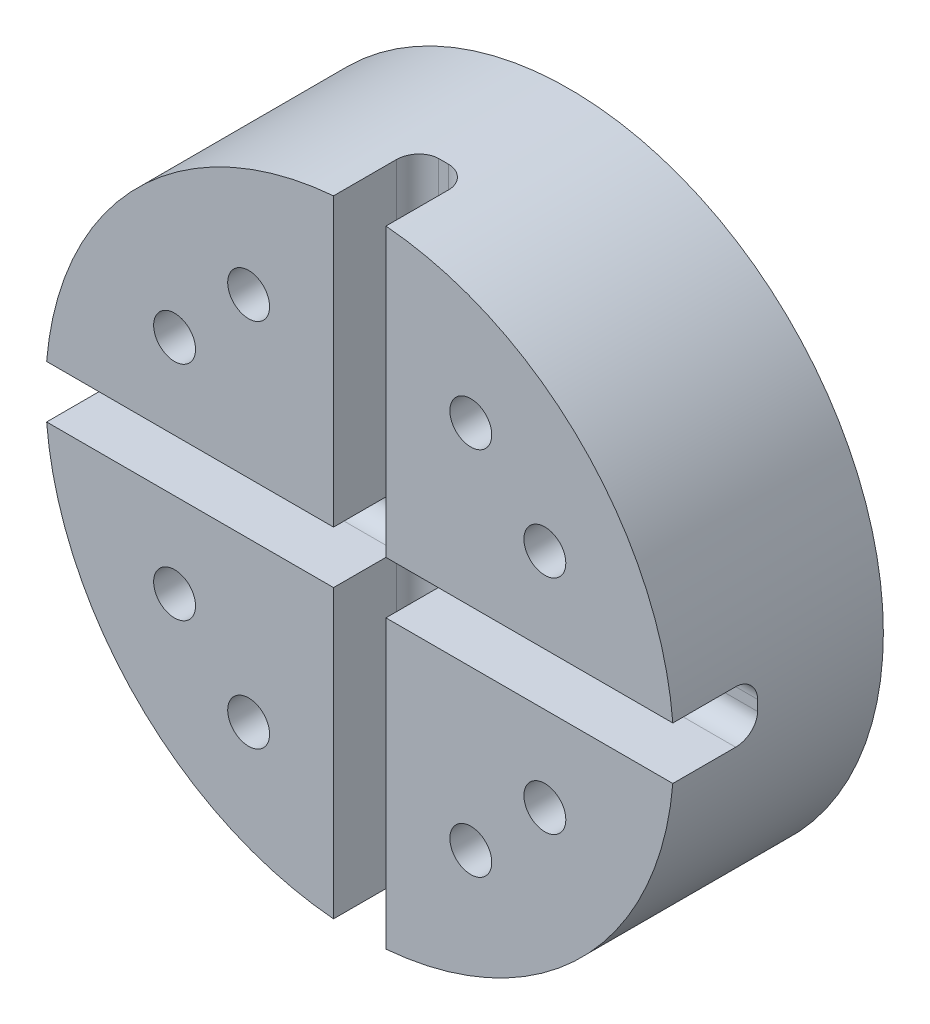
ISO-10303-21;
HEADER;
FILE_DESCRIPTION(('STEP AP214'),'2;1');
FILE_NAME('part.step','',(''),(''),'','','');
FILE_SCHEMA(('AUTOMOTIVE_DESIGN { 1 0 10303 214 1 1 1 1 }'));
ENDSEC;
DATA;
#1=APPLICATION_CONTEXT('core data for automotive mechanical design processes');
#2=APPLICATION_PROTOCOL_DEFINITION('international standard','automotive_design',2000,#1);
#3=PRODUCT_CONTEXT('',#1,'mechanical');
#4=PRODUCT('Part','Part','',(#3));
#5=PRODUCT_RELATED_PRODUCT_CATEGORY('part','',(#4));
#6=PRODUCT_DEFINITION_FORMATION('','',#4);
#7=PRODUCT_DEFINITION_CONTEXT('part definition',#1,'design');
#8=PRODUCT_DEFINITION('design','',#6,#7);
#9=PRODUCT_DEFINITION_SHAPE('','',#8);
#10=(LENGTH_UNIT() NAMED_UNIT(*) SI_UNIT(.MILLI.,.METRE.));
#11=(NAMED_UNIT(*) PLANE_ANGLE_UNIT() SI_UNIT($,.RADIAN.));
#12=(NAMED_UNIT(*) SI_UNIT($,.STERADIAN.) SOLID_ANGLE_UNIT());
#13=UNCERTAINTY_MEASURE_WITH_UNIT(LENGTH_MEASURE(1.E-05),#10,'distance_accuracy_value','');
#14=(GEOMETRIC_REPRESENTATION_CONTEXT(3) GLOBAL_UNCERTAINTY_ASSIGNED_CONTEXT((#13)) GLOBAL_UNIT_ASSIGNED_CONTEXT((#10,
#11,#12)) REPRESENTATION_CONTEXT('',''));
#15=CARTESIAN_POINT('',(0.,0.,0.));
#16=DIRECTION('',(0.,0.,1.));
#17=DIRECTION('',(1.,0.,0.));
#18=AXIS2_PLACEMENT_3D('',#15,#16,#17);
#19=CARTESIAN_POINT('',(0.,0.,10.));
#20=DIRECTION('',(0.,0.,1.));
#21=DIRECTION('',(1.,0.,0.));
#22=AXIS2_PLACEMENT_3D('',#19,#20,#21);
#23=PLANE('',#22);
#24=CARTESIAN_POINT('',(-5.30330085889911,8.83883476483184,10.));
#25=DIRECTION('',(0.,0.,1.));
#26=DIRECTION('',(1.,0.,0.));
#27=AXIS2_PLACEMENT_3D('',#24,#25,#26);
#28=CIRCLE('',#27,1.);
#29=CARTESIAN_POINT('',(-4.30330085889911,8.83883476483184,10.));
#30=VERTEX_POINT('',#29);
#31=EDGE_CURVE('E392',#30,#30,#28,.T.);
#32=ORIENTED_EDGE('',*,*,#31,.F.);
#33=EDGE_LOOP('',(#32));
#34=FACE_BOUND('',#33,.T.);
#35=CARTESIAN_POINT('',(-8.83883476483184,5.30330085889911,10.));
#36=DIRECTION('',(0.,0.,1.));
#37=DIRECTION('',(1.,0.,0.));
#38=AXIS2_PLACEMENT_3D('',#35,#36,#37);
#39=CIRCLE('',#38,1.);
#40=CARTESIAN_POINT('',(-7.83883476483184,5.30330085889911,10.));
#41=VERTEX_POINT('',#40);
#42=EDGE_CURVE('E398',#41,#41,#39,.T.);
#43=ORIENTED_EDGE('',*,*,#42,.F.);
#44=EDGE_LOOP('',(#43));
#45=FACE_BOUND('',#44,.T.);
#46=DIRECTION('',(-1.,0.,0.));
#47=VECTOR('',#46,1.);
#48=CARTESIAN_POINT('',(-1.25,1.25,10.));
#49=LINE('',#48,#47);
#50=CARTESIAN_POINT('',(-1.25,1.25,10.));
#51=VERTEX_POINT('',#50);
#52=CARTESIAN_POINT('',(-14.9478259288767,1.25,10.));
#53=VERTEX_POINT('',#52);
#54=EDGE_CURVE('E197',#51,#53,#49,.T.);
#55=ORIENTED_EDGE('',*,*,#54,.F.);
#56=DIRECTION('',(0.,-1.,0.));
#57=VECTOR('',#56,1.);
#58=CARTESIAN_POINT('',(-1.25,0.,10.));
#59=LINE('',#58,#57);
#60=CARTESIAN_POINT('',(-1.25,14.9478259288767,10.));
#61=VERTEX_POINT('',#60);
#62=EDGE_CURVE('E261',#61,#51,#59,.T.);
#63=ORIENTED_EDGE('',*,*,#62,.F.);
#64=CARTESIAN_POINT('',(0.,0.,10.));
#65=DIRECTION('',(0.,0.,1.));
#66=DIRECTION('',(1.,0.,0.));
#67=AXIS2_PLACEMENT_3D('',#64,#65,#66);
#68=CIRCLE('',#67,15.);
#69=EDGE_CURVE('E249',#61,#53,#68,.T.);
#70=ORIENTED_EDGE('',*,*,#69,.T.);
#71=EDGE_LOOP('',(#55,#63,#70));
#72=FACE_BOUND('',#71,.T.);
#73=ADVANCED_FACE('F42',(#34,#45,#72),#23,.T.);
#74=CARTESIAN_POINT('',(8.83883476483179,5.3033008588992,10.));
#75=DIRECTION('',(0.,0.,1.));
#76=DIRECTION('',(0.,-1.,0.));
#77=AXIS2_PLACEMENT_3D('',#74,#75,#76);
#78=CIRCLE('',#77,1.);
#79=CARTESIAN_POINT('',(9.83883476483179,5.3033008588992,10.));
#80=VERTEX_POINT('',#79);
#81=EDGE_CURVE('E882',#80,#80,#78,.T.);
#82=ORIENTED_EDGE('',*,*,#81,.F.);
#83=EDGE_LOOP('',(#82));
#84=FACE_BOUND('',#83,.T.);
#85=CARTESIAN_POINT('',(5.30330085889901,8.8388347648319,10.));
#86=DIRECTION('',(0.,0.,1.));
#87=DIRECTION('',(0.,-1.,0.));
#88=AXIS2_PLACEMENT_3D('',#85,#86,#87);
#89=CIRCLE('',#88,1.);
#90=CARTESIAN_POINT('',(6.30330085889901,8.8388347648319,10.));
#91=VERTEX_POINT('',#90);
#92=EDGE_CURVE('E888',#91,#91,#89,.T.);
#93=ORIENTED_EDGE('',*,*,#92,.F.);
#94=EDGE_LOOP('',(#93));
#95=FACE_BOUND('',#94,.T.);
#96=DIRECTION('',(0.,1.,0.));
#97=VECTOR('',#96,1.);
#98=CARTESIAN_POINT('',(1.25,1.25,10.));
#99=LINE('',#98,#97);
#100=CARTESIAN_POINT('',(1.25,1.25,10.));
#101=VERTEX_POINT('',#100);
#102=CARTESIAN_POINT('',(1.25,14.9478259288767,10.));
#103=VERTEX_POINT('',#102);
#104=EDGE_CURVE('E181',#101,#103,#99,.T.);
#105=ORIENTED_EDGE('',*,*,#104,.F.);
#106=DIRECTION('',(-1.,0.,0.));
#107=VECTOR('',#106,1.);
#108=CARTESIAN_POINT('',(0.,1.25,10.));
#109=LINE('',#108,#107);
#110=CARTESIAN_POINT('',(14.9478259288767,1.25,10.));
#111=VERTEX_POINT('',#110);
#112=EDGE_CURVE('E257',#111,#101,#109,.T.);
#113=ORIENTED_EDGE('',*,*,#112,.F.);
#114=EDGE_CURVE('E191',#111,#103,#68,.T.);
#115=ORIENTED_EDGE('',*,*,#114,.T.);
#116=EDGE_LOOP('',(#105,#113,#115));
#117=FACE_BOUND('',#116,.T.);
#118=ADVANCED_FACE('F414',(#84,#95,#117),#23,.T.);
#119=CARTESIAN_POINT('',(5.30330085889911,-8.83883476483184,10.));
#120=DIRECTION('',(0.,0.,1.));
#121=DIRECTION('',(-1.,0.,0.));
#122=AXIS2_PLACEMENT_3D('',#119,#120,#121);
#123=CIRCLE('',#122,1.);
#124=CARTESIAN_POINT('',(6.30330085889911,-8.83883476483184,10.));
#125=VERTEX_POINT('',#124);
#126=EDGE_CURVE('E870',#125,#125,#123,.T.);
#127=ORIENTED_EDGE('',*,*,#126,.F.);
#128=EDGE_LOOP('',(#127));
#129=FACE_BOUND('',#128,.T.);
#130=CARTESIAN_POINT('',(8.83883476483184,-5.30330085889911,10.));
#131=DIRECTION('',(0.,0.,1.));
#132=DIRECTION('',(-1.,0.,0.));
#133=AXIS2_PLACEMENT_3D('',#130,#131,#132);
#134=CIRCLE('',#133,1.);
#135=CARTESIAN_POINT('',(9.83883476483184,-5.30330085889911,10.));
#136=VERTEX_POINT('',#135);
#137=EDGE_CURVE('E876',#136,#136,#134,.T.);
#138=ORIENTED_EDGE('',*,*,#137,.F.);
#139=EDGE_LOOP('',(#138));
#140=FACE_BOUND('',#139,.T.);
#141=DIRECTION('',(1.,0.,0.));
#142=VECTOR('',#141,1.);
#143=CARTESIAN_POINT('',(1.25,-1.25,10.));
#144=LINE('',#143,#142);
#145=CARTESIAN_POINT('',(1.25,-1.25,10.));
#146=VERTEX_POINT('',#145);
#147=CARTESIAN_POINT('',(14.9478259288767,-1.25,10.));
#148=VERTEX_POINT('',#147);
#149=EDGE_CURVE('E196',#146,#148,#144,.T.);
#150=ORIENTED_EDGE('',*,*,#149,.F.);
#151=DIRECTION('',(0.,1.,0.));
#152=VECTOR('',#151,1.);
#153=CARTESIAN_POINT('',(1.25,0.,10.));
#154=LINE('',#153,#152);
#155=CARTESIAN_POINT('',(1.25,-14.9478259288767,10.));
#156=VERTEX_POINT('',#155);
#157=EDGE_CURVE('E190',#156,#146,#154,.T.);
#158=ORIENTED_EDGE('',*,*,#157,.F.);
#159=EDGE_CURVE('E250',#156,#148,#68,.T.);
#160=ORIENTED_EDGE('',*,*,#159,.T.);
#161=EDGE_LOOP('',(#150,#158,#160));
#162=FACE_BOUND('',#161,.T.);
#163=ADVANCED_FACE('F504',(#129,#140,#162),#23,.T.);
#164=CARTESIAN_POINT('',(0.,0.,10.));
#165=DIRECTION('',(0.,0.,-1.));
#166=DIRECTION('',(-1.,0.,0.));
#167=AXIS2_PLACEMENT_3D('',#164,#165,#166);
#168=CYLINDRICAL_SURFACE('',#167,15.);
#169=ORIENTED_EDGE('',*,*,#69,.F.);
#170=DIRECTION('',(0.,0.,-1.));
#171=VECTOR('',#170,1.);
#172=CARTESIAN_POINT('',(-1.25,14.9478259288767,10.));
#173=LINE('',#172,#171);
#174=CARTESIAN_POINT('',(-1.25,14.9478259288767,7.));
#175=VERTEX_POINT('',#174);
#176=EDGE_CURVE('E238',#61,#175,#173,.T.);
#177=ORIENTED_EDGE('',*,*,#176,.T.);
#178=CARTESIAN_POINT('',(-1.25,14.9478259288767,7.));
#179=CARTESIAN_POINT('',(-1.24999987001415,14.9478254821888,6.97192066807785));
#180=CARTESIAN_POINT('',(-1.24881658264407,14.9479249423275,6.94385483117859));
#181=CARTESIAN_POINT('',(-1.24409634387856,14.9483187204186,6.88792487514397));
#182=CARTESIAN_POINT('',(-1.24055953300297,14.9486130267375,6.86006074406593));
#183=CARTESIAN_POINT('',(-1.22645438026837,14.9497794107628,6.77712673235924));
#184=CARTESIAN_POINT('',(-1.21239121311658,14.9509349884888,6.72261376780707));
#185=CARTESIAN_POINT('',(-1.17534251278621,14.953892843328,6.61673399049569));
#186=CARTESIAN_POINT('',(-1.15235319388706,14.9556953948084,6.56536852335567));
#187=CARTESIAN_POINT('',(-1.09811115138,14.9597756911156,6.46722536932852));
#188=CARTESIAN_POINT('',(-1.06685948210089,14.9620533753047,6.42044709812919));
#189=CARTESIAN_POINT('',(-0.996904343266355,14.9668770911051,6.33269977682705));
#190=CARTESIAN_POINT('',(-0.958185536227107,14.9694236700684,6.29174299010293));
#191=CARTESIAN_POINT('',(-0.874420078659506,14.9745499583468,6.21689445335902));
#192=CARTESIAN_POINT('',(-0.829372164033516,14.9771296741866,6.18300411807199));
#193=CARTESIAN_POINT('',(-0.734121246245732,14.9821007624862,6.12318898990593));
#194=CARTESIAN_POINT('',(-0.683906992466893,14.9844917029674,6.09728209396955));
#195=CARTESIAN_POINT('',(-0.579833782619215,14.9888791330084,6.05428612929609));
#196=CARTESIAN_POINT('',(-0.525977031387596,14.9908758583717,6.03719177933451));
#197=CARTESIAN_POINT('',(-0.434830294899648,14.9937400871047,6.01652499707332));
#198=CARTESIAN_POINT('',(-0.39811776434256,14.9947608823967,6.01033271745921));
#199=CARTESIAN_POINT('',(-0.324276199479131,14.9965403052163,6.00207051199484));
#200=CARTESIAN_POINT('',(-0.287147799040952,14.9972992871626,5.99999499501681));
#201=CARTESIAN_POINT('',(-0.249999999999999,14.9979165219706,6.));
#202=B_SPLINE_CURVE_WITH_KNOTS('',3,(#178,#179,#180,#181,#182,#183,#184,#185,#186,#187,#188,
#189,#190,#191,#192,#193,#194,#195,#196,#197,#198,#199,#200,#201),.UNSPECIFIED.,.F.,.F.,(4,2,2,
2,2,2,2,2,2,2,2,4),(0.,0.0841861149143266,0.168367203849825,0.336428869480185,0.504561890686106,
0.672673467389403,0.841134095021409,1.00962841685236,1.17849775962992,1.34726578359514,
1.4587849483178,1.57015255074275),.UNSPECIFIED.);
#203=CARTESIAN_POINT('',(-0.249999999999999,14.9979165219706,6.));
#204=VERTEX_POINT('',#203);
#205=EDGE_CURVE('E360',#175,#204,#202,.T.);
#206=ORIENTED_EDGE('',*,*,#205,.T.);
#207=CARTESIAN_POINT('',(0.,0.,6.));
#208=DIRECTION('',(0.,0.,1.));
#209=DIRECTION('',(1.,0.,0.));
#210=AXIS2_PLACEMENT_3D('',#207,#208,#209);
#211=CIRCLE('',#210,15.);
#212=CARTESIAN_POINT('',(0.250000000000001,14.9979165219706,6.));
#213=VERTEX_POINT('',#212);
#214=EDGE_CURVE('E270',#213,#204,#211,.T.);
#215=ORIENTED_EDGE('',*,*,#214,.F.);
#216=CARTESIAN_POINT('',(0.250000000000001,14.9979165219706,6.));
#217=CARTESIAN_POINT('',(0.278124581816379,14.9974481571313,6.00000015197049));
#218=CARTESIAN_POINT('',(0.306234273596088,14.9968999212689,6.00118722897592));
#219=CARTESIAN_POINT('',(0.362248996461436,14.9956513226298,6.00592205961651));
#220=CARTESIAN_POINT('',(0.390154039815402,14.9949509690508,6.00946967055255));
#221=CARTESIAN_POINT('',(0.473207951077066,14.9926357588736,6.0236172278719));
#222=CARTESIAN_POINT('',(0.527795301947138,14.9908050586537,6.0377220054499));
#223=CARTESIAN_POINT('',(0.633810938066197,14.9866976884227,6.07487841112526));
#224=CARTESIAN_POINT('',(0.685237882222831,14.9844208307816,6.0979338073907));
#225=CARTESIAN_POINT('',(0.783489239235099,14.979604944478,6.15233256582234));
#226=CARTESIAN_POINT('',(0.830314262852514,14.9770659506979,6.18367482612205));
#227=CARTESIAN_POINT('',(0.918119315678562,14.9719403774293,6.25382281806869));
#228=CARTESIAN_POINT('',(0.959089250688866,14.9693537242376,6.29264117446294));
#229=CARTESIAN_POINT('',(1.03394194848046,14.9643701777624,6.37662299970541));
#230=CARTESIAN_POINT('',(1.06782335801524,14.9619733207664,6.4217876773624));
#231=CARTESIAN_POINT('',(1.12754203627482,14.957591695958,6.517205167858));
#232=CARTESIAN_POINT('',(1.15337450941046,14.9556071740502,6.56746099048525));
#233=CARTESIAN_POINT('',(1.19621528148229,14.9522417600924,6.67160694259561));
#234=CARTESIAN_POINT('',(1.21322899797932,14.9508604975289,6.72549481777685));
#235=CARTESIAN_POINT('',(1.23370146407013,14.9491821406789,6.81642958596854));
#236=CARTESIAN_POINT('',(1.23980930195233,14.9486755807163,6.85289819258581));
#237=CARTESIAN_POINT('',(1.24795822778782,14.9479966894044,6.92623930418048));
#238=CARTESIAN_POINT('',(1.25000487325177,14.947823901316,6.96311118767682));
#239=CARTESIAN_POINT('',(1.25,14.9478259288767,7.));
#240=B_SPLINE_CURVE_WITH_KNOTS('',3,(#216,#217,#218,#219,#220,#221,#222,#223,#224,#225,#226,
#227,#228,#229,#230,#231,#232,#233,#234,#235,#236,#237,#238,#239),.UNSPECIFIED.,.F.,.F.,(4,2,2,
2,2,2,2,2,2,2,2,4),(0.,0.0843334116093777,0.168661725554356,0.337023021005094,0.50545527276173,
0.673865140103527,0.842561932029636,1.01129089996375,1.18012020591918,1.34884567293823,
1.45957373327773,1.57015016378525),.UNSPECIFIED.);
#241=CARTESIAN_POINT('',(1.25,14.9478259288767,7.));
#242=VERTEX_POINT('',#241);
#243=EDGE_CURVE('E433',#213,#242,#240,.T.);
#244=ORIENTED_EDGE('',*,*,#243,.T.);
#245=DIRECTION('',(0.,0.,-1.));
#246=VECTOR('',#245,1.);
#247=CARTESIAN_POINT('',(1.25,14.9478259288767,10.));
#248=LINE('',#247,#246);
#249=EDGE_CURVE('E235',#242,#103,#248,.F.);
#250=ORIENTED_EDGE('',*,*,#249,.T.);
#251=ORIENTED_EDGE('',*,*,#114,.F.);
#252=DIRECTION('',(0.,0.,-1.));
#253=VECTOR('',#252,1.);
#254=CARTESIAN_POINT('',(14.9478259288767,1.25,10.));
#255=LINE('',#254,#253);
#256=CARTESIAN_POINT('',(14.9478259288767,1.25,7.));
#257=VERTEX_POINT('',#256);
#258=EDGE_CURVE('E231',#111,#257,#255,.T.);
#259=ORIENTED_EDGE('',*,*,#258,.T.);
#260=CARTESIAN_POINT('',(14.9478259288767,1.25,7.));
#261=CARTESIAN_POINT('',(14.9478254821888,1.24999987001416,6.97192066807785));
#262=CARTESIAN_POINT('',(14.9479249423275,1.24881658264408,6.94385483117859));
#263=CARTESIAN_POINT('',(14.9483187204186,1.24409634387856,6.88792487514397));
#264=CARTESIAN_POINT('',(14.9486130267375,1.24055953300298,6.86006074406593));
#265=CARTESIAN_POINT('',(14.9497794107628,1.22645438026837,6.77712673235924));
#266=CARTESIAN_POINT('',(14.9509349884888,1.21239121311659,6.72261376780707));
#267=CARTESIAN_POINT('',(14.953892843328,1.17534251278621,6.61673399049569));
#268=CARTESIAN_POINT('',(14.9556953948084,1.15235319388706,6.56536852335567));
#269=CARTESIAN_POINT('',(14.9597756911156,1.09811115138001,6.46722536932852));
#270=CARTESIAN_POINT('',(14.9620533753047,1.06685948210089,6.42044709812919));
#271=CARTESIAN_POINT('',(14.9668770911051,0.996904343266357,6.33269977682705));
#272=CARTESIAN_POINT('',(14.9694236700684,0.958185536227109,6.29174299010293));
#273=CARTESIAN_POINT('',(14.9745499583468,0.874420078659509,6.21689445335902));
#274=CARTESIAN_POINT('',(14.9771296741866,0.829372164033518,6.18300411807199));
#275=CARTESIAN_POINT('',(14.9821007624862,0.734121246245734,6.12318898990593));
#276=CARTESIAN_POINT('',(14.9844917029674,0.683906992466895,6.09728209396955));
#277=CARTESIAN_POINT('',(14.9888791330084,0.579833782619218,6.05428612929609));
#278=CARTESIAN_POINT('',(14.9908758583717,0.525977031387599,6.03719177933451));
#279=CARTESIAN_POINT('',(14.9937400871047,0.43483029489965,6.01652499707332));
#280=CARTESIAN_POINT('',(14.9947608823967,0.398117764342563,6.01033271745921));
#281=CARTESIAN_POINT('',(14.9965403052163,0.324276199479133,6.00207051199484));
#282=CARTESIAN_POINT('',(14.9972992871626,0.287147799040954,5.99999499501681));
#283=CARTESIAN_POINT('',(14.9979165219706,0.250000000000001,6.));
#284=B_SPLINE_CURVE_WITH_KNOTS('',3,(#260,#261,#262,#263,#264,#265,#266,#267,#268,#269,#270,
#271,#272,#273,#274,#275,#276,#277,#278,#279,#280,#281,#282,#283),.UNSPECIFIED.,.F.,.F.,(4,2,2,
2,2,2,2,2,2,2,2,4),(0.,0.0841861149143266,0.168367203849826,0.336428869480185,0.504561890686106,
0.672673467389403,0.841134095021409,1.00962841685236,1.17849775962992,1.34726578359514,
1.4587849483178,1.57015255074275),.UNSPECIFIED.);
#285=CARTESIAN_POINT('',(14.9979165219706,0.250000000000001,6.));
#286=VERTEX_POINT('',#285);
#287=EDGE_CURVE('E435',#257,#286,#284,.T.);
#288=ORIENTED_EDGE('',*,*,#287,.T.);
#289=CARTESIAN_POINT('',(14.9979165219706,-0.249999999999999,6.));
#290=VERTEX_POINT('',#289);
#291=EDGE_CURVE('E265',#290,#286,#211,.T.);
#292=ORIENTED_EDGE('',*,*,#291,.F.);
#293=CARTESIAN_POINT('',(14.9979165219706,-0.249999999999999,6.));
#294=CARTESIAN_POINT('',(14.9974481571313,-0.278124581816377,6.00000015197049));
#295=CARTESIAN_POINT('',(14.9968999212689,-0.306234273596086,6.00118722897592));
#296=CARTESIAN_POINT('',(14.9956513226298,-0.362248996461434,6.00592205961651));
#297=CARTESIAN_POINT('',(14.9949509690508,-0.3901540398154,6.00946967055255));
#298=CARTESIAN_POINT('',(14.9926357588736,-0.473207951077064,6.0236172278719));
#299=CARTESIAN_POINT('',(14.9908050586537,-0.527795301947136,6.0377220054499));
#300=CARTESIAN_POINT('',(14.9866976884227,-0.633810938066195,6.07487841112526));
#301=CARTESIAN_POINT('',(14.9844208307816,-0.685237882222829,6.0979338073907));
#302=CARTESIAN_POINT('',(14.979604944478,-0.783489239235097,6.15233256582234));
#303=CARTESIAN_POINT('',(14.9770659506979,-0.830314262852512,6.18367482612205));
#304=CARTESIAN_POINT('',(14.9719403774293,-0.91811931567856,6.25382281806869));
#305=CARTESIAN_POINT('',(14.9693537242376,-0.959089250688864,6.29264117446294));
#306=CARTESIAN_POINT('',(14.9643701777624,-1.03394194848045,6.37662299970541));
#307=CARTESIAN_POINT('',(14.9619733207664,-1.06782335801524,6.4217876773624));
#308=CARTESIAN_POINT('',(14.957591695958,-1.12754203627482,6.517205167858));
#309=CARTESIAN_POINT('',(14.9556071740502,-1.15337450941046,6.56746099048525));
#310=CARTESIAN_POINT('',(14.9522417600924,-1.19621528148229,6.67160694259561));
#311=CARTESIAN_POINT('',(14.9508604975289,-1.21322899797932,6.72549481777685));
#312=CARTESIAN_POINT('',(14.9491821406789,-1.23370146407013,6.81642958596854));
#313=CARTESIAN_POINT('',(14.9486755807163,-1.23980930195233,6.85289819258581));
#314=CARTESIAN_POINT('',(14.9479966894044,-1.24795822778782,6.92623930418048));
#315=CARTESIAN_POINT('',(14.947823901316,-1.25000487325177,6.96311118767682));
#316=CARTESIAN_POINT('',(14.9478259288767,-1.25,7.));
#317=B_SPLINE_CURVE_WITH_KNOTS('',3,(#293,#294,#295,#296,#297,#298,#299,#300,#301,#302,#303,
#304,#305,#306,#307,#308,#309,#310,#311,#312,#313,#314,#315,#316),.UNSPECIFIED.,.F.,.F.,(4,2,2,
2,2,2,2,2,2,2,2,4),(0.,0.0843334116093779,0.168661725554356,0.337023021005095,0.50545527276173,
0.673865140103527,0.842561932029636,1.01129089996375,1.18012020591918,1.34884567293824,
1.45957373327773,1.57015016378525),.UNSPECIFIED.);
#318=CARTESIAN_POINT('',(14.9478259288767,-1.25,7.));
#319=VERTEX_POINT('',#318);
#320=EDGE_CURVE('E439',#290,#319,#317,.T.);
#321=ORIENTED_EDGE('',*,*,#320,.T.);
#322=DIRECTION('',(0.,0.,-1.));
#323=VECTOR('',#322,1.);
#324=CARTESIAN_POINT('',(14.9478259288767,-1.25,10.));
#325=LINE('',#324,#323);
#326=EDGE_CURVE('E228',#319,#148,#325,.F.);
#327=ORIENTED_EDGE('',*,*,#326,.T.);
#328=ORIENTED_EDGE('',*,*,#159,.F.);
#329=DIRECTION('',(0.,0.,-1.));
#330=VECTOR('',#329,1.);
#331=CARTESIAN_POINT('',(1.25,-14.9478259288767,10.));
#332=LINE('',#331,#330);
#333=CARTESIAN_POINT('',(1.25,-14.9478259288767,7.));
#334=VERTEX_POINT('',#333);
#335=EDGE_CURVE('E224',#156,#334,#332,.T.);
#336=ORIENTED_EDGE('',*,*,#335,.T.);
#337=CARTESIAN_POINT('',(1.25,-14.9478259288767,7.));
#338=CARTESIAN_POINT('',(1.24999987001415,-14.9478254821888,6.97192066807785));
#339=CARTESIAN_POINT('',(1.24881658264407,-14.9479249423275,6.94385483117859));
#340=CARTESIAN_POINT('',(1.24409634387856,-14.9483187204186,6.88792487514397));
#341=CARTESIAN_POINT('',(1.24055953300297,-14.9486130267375,6.86006074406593));
#342=CARTESIAN_POINT('',(1.22645438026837,-14.9497794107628,6.77712673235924));
#343=CARTESIAN_POINT('',(1.21239121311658,-14.9509349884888,6.72261376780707));
#344=CARTESIAN_POINT('',(1.17534251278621,-14.953892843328,6.61673399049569));
#345=CARTESIAN_POINT('',(1.15235319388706,-14.9556953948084,6.56536852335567));
#346=CARTESIAN_POINT('',(1.09811115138,-14.9597756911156,6.46722536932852));
#347=CARTESIAN_POINT('',(1.06685948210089,-14.9620533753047,6.42044709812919));
#348=CARTESIAN_POINT('',(0.996904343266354,-14.9668770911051,6.33269977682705));
#349=CARTESIAN_POINT('',(0.958185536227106,-14.9694236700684,6.29174299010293));
#350=CARTESIAN_POINT('',(0.874420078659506,-14.9745499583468,6.21689445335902));
#351=CARTESIAN_POINT('',(0.829372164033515,-14.9771296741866,6.18300411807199));
#352=CARTESIAN_POINT('',(0.734121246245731,-14.9821007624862,6.12318898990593));
#353=CARTESIAN_POINT('',(0.683906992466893,-14.9844917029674,6.09728209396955));
#354=CARTESIAN_POINT('',(0.579833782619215,-14.9888791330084,6.05428612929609));
#355=CARTESIAN_POINT('',(0.525977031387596,-14.9908758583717,6.03719177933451));
#356=CARTESIAN_POINT('',(0.434830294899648,-14.9937400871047,6.01652499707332));
#357=CARTESIAN_POINT('',(0.39811776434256,-14.9947608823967,6.01033271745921));
#358=CARTESIAN_POINT('',(0.32427619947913,-14.9965403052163,6.00207051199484));
#359=CARTESIAN_POINT('',(0.287147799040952,-14.9972992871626,5.99999499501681));
#360=CARTESIAN_POINT('',(0.249999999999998,-14.9979165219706,6.));
#361=B_SPLINE_CURVE_WITH_KNOTS('',3,(#337,#338,#339,#340,#341,#342,#343,#344,#345,#346,#347,
#348,#349,#350,#351,#352,#353,#354,#355,#356,#357,#358,#359,#360),.UNSPECIFIED.,.F.,.F.,(4,2,2,
2,2,2,2,2,2,2,2,4),(0.,0.0841861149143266,0.168367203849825,0.336428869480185,0.504561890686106,
0.672673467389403,0.841134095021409,1.00962841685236,1.17849775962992,1.34726578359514,
1.4587849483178,1.57015255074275),.UNSPECIFIED.);
#362=CARTESIAN_POINT('',(0.249999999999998,-14.9979165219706,6.));
#363=VERTEX_POINT('',#362);
#364=EDGE_CURVE('E330',#334,#363,#361,.T.);
#365=ORIENTED_EDGE('',*,*,#364,.T.);
#366=CARTESIAN_POINT('',(-0.250000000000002,-14.9979165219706,6.));
#367=VERTEX_POINT('',#366);
#368=EDGE_CURVE('E269',#367,#363,#211,.T.);
#369=ORIENTED_EDGE('',*,*,#368,.F.);
#370=CARTESIAN_POINT('',(-0.250000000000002,-14.9979165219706,6.));
#371=CARTESIAN_POINT('',(-0.278124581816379,-14.9974481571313,6.00000015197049));
#372=CARTESIAN_POINT('',(-0.306234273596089,-14.9968999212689,6.00118722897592));
#373=CARTESIAN_POINT('',(-0.362248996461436,-14.9956513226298,6.00592205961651));
#374=CARTESIAN_POINT('',(-0.390154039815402,-14.9949509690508,6.00946967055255));
#375=CARTESIAN_POINT('',(-0.473207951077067,-14.9926357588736,6.0236172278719));
#376=CARTESIAN_POINT('',(-0.527795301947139,-14.9908050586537,6.0377220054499));
#377=CARTESIAN_POINT('',(-0.633810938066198,-14.9866976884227,6.07487841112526));
#378=CARTESIAN_POINT('',(-0.685237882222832,-14.9844208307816,6.09793380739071));
#379=CARTESIAN_POINT('',(-0.7834892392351,-14.979604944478,6.15233256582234));
#380=CARTESIAN_POINT('',(-0.830314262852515,-14.9770659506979,6.18367482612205));
#381=CARTESIAN_POINT('',(-0.918119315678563,-14.9719403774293,6.25382281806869));
#382=CARTESIAN_POINT('',(-0.959089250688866,-14.9693537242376,6.29264117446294));
#383=CARTESIAN_POINT('',(-1.03394194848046,-14.9643701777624,6.37662299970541));
#384=CARTESIAN_POINT('',(-1.06782335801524,-14.9619733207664,6.4217876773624));
#385=CARTESIAN_POINT('',(-1.12754203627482,-14.957591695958,6.517205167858));
#386=CARTESIAN_POINT('',(-1.15337450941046,-14.9556071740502,6.56746099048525));
#387=CARTESIAN_POINT('',(-1.1962152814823,-14.9522417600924,6.67160694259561));
#388=CARTESIAN_POINT('',(-1.21322899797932,-14.9508604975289,6.72549481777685));
#389=CARTESIAN_POINT('',(-1.23370146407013,-14.9491821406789,6.81642958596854));
#390=CARTESIAN_POINT('',(-1.23980930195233,-14.9486755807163,6.85289819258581));
#391=CARTESIAN_POINT('',(-1.24795822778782,-14.9479966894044,6.92623930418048));
#392=CARTESIAN_POINT('',(-1.25000487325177,-14.947823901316,6.96311118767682));
#393=CARTESIAN_POINT('',(-1.25,-14.9478259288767,7.));
#394=B_SPLINE_CURVE_WITH_KNOTS('',3,(#370,#371,#372,#373,#374,#375,#376,#377,#378,#379,#380,
#381,#382,#383,#384,#385,#386,#387,#388,#389,#390,#391,#392,#393),.UNSPECIFIED.,.F.,.F.,(4,2,2,
2,2,2,2,2,2,2,2,4),(0.,0.0843334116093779,0.168661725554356,0.337023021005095,0.505455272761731,
0.673865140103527,0.842561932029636,1.01129089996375,1.18012020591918,1.34884567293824,
1.45957373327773,1.57015016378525),.UNSPECIFIED.);
#395=CARTESIAN_POINT('',(-1.25,-14.9478259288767,7.));
#396=VERTEX_POINT('',#395);
#397=EDGE_CURVE('E321',#367,#396,#394,.T.);
#398=ORIENTED_EDGE('',*,*,#397,.T.);
#399=DIRECTION('',(0.,0.,-1.));
#400=VECTOR('',#399,1.);
#401=CARTESIAN_POINT('',(-1.25,-14.9478259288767,10.));
#402=LINE('',#401,#400);
#403=CARTESIAN_POINT('',(-1.25,-14.9478259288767,10.));
#404=VERTEX_POINT('',#403);
#405=EDGE_CURVE('E221',#396,#404,#402,.F.);
#406=ORIENTED_EDGE('',*,*,#405,.T.);
#407=CARTESIAN_POINT('',(-14.9478259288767,-1.25,10.));
#408=VERTEX_POINT('',#407);
#409=EDGE_CURVE('E194',#408,#404,#68,.T.);
#410=ORIENTED_EDGE('',*,*,#409,.F.);
#411=DIRECTION('',(0.,0.,-1.));
#412=VECTOR('',#411,1.);
#413=CARTESIAN_POINT('',(-14.9478259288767,-1.25,10.));
#414=LINE('',#413,#412);
#415=CARTESIAN_POINT('',(-14.9478259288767,-1.25,7.));
#416=VERTEX_POINT('',#415);
#417=EDGE_CURVE('E186',#408,#416,#414,.T.);
#418=ORIENTED_EDGE('',*,*,#417,.T.);
#419=CARTESIAN_POINT('',(-14.9478259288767,-1.25,7.));
#420=CARTESIAN_POINT('',(-14.9478254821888,-1.24999987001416,6.97192066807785));
#421=CARTESIAN_POINT('',(-14.9479249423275,-1.24881658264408,6.94385483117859));
#422=CARTESIAN_POINT('',(-14.9483187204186,-1.24409634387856,6.88792487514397));
#423=CARTESIAN_POINT('',(-14.9486130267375,-1.24055953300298,6.86006074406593));
#424=CARTESIAN_POINT('',(-14.9497794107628,-1.22645438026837,6.77712673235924));
#425=CARTESIAN_POINT('',(-14.9509349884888,-1.21239121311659,6.72261376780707));
#426=CARTESIAN_POINT('',(-14.953892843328,-1.17534251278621,6.61673399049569));
#427=CARTESIAN_POINT('',(-14.9556953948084,-1.15235319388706,6.56536852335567));
#428=CARTESIAN_POINT('',(-14.9597756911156,-1.09811115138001,6.46722536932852));
#429=CARTESIAN_POINT('',(-14.9620533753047,-1.06685948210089,6.42044709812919));
#430=CARTESIAN_POINT('',(-14.9668770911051,-0.996904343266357,6.33269977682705));
#431=CARTESIAN_POINT('',(-14.9694236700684,-0.958185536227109,6.29174299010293));
#432=CARTESIAN_POINT('',(-14.9745499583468,-0.874420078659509,6.21689445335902));
#433=CARTESIAN_POINT('',(-14.9771296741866,-0.829372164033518,6.18300411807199));
#434=CARTESIAN_POINT('',(-14.9821007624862,-0.734121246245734,6.12318898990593));
#435=CARTESIAN_POINT('',(-14.9844917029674,-0.683906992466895,6.09728209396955));
#436=CARTESIAN_POINT('',(-14.9888791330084,-0.579833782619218,6.05428612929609));
#437=CARTESIAN_POINT('',(-14.9908758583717,-0.525977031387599,6.03719177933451));
#438=CARTESIAN_POINT('',(-14.9937400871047,-0.434830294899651,6.01652499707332));
#439=CARTESIAN_POINT('',(-14.9947608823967,-0.398117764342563,6.01033271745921));
#440=CARTESIAN_POINT('',(-14.9965403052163,-0.324276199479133,6.00207051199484));
#441=CARTESIAN_POINT('',(-14.9972992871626,-0.287147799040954,5.99999499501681));
#442=CARTESIAN_POINT('',(-14.9979165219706,-0.250000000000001,6.));
#443=B_SPLINE_CURVE_WITH_KNOTS('',3,(#419,#420,#421,#422,#423,#424,#425,#426,#427,#428,#429,
#430,#431,#432,#433,#434,#435,#436,#437,#438,#439,#440,#441,#442),.UNSPECIFIED.,.F.,.F.,(4,2,2,
2,2,2,2,2,2,2,2,4),(0.,0.0841861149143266,0.168367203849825,0.336428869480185,0.504561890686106,
0.672673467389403,0.841134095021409,1.00962841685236,1.17849775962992,1.34726578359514,
1.4587849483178,1.57015255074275),.UNSPECIFIED.);
#444=CARTESIAN_POINT('',(-14.9979165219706,-0.250000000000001,6.));
#445=VERTEX_POINT('',#444);
#446=EDGE_CURVE('E53',#416,#445,#443,.T.);
#447=ORIENTED_EDGE('',*,*,#446,.T.);
#448=CARTESIAN_POINT('',(-14.9979165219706,0.249999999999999,6.));
#449=VERTEX_POINT('',#448);
#450=EDGE_CURVE('E475',#449,#445,#211,.T.);
#451=ORIENTED_EDGE('',*,*,#450,.F.);
#452=CARTESIAN_POINT('',(-14.9979165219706,0.249999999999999,6.));
#453=CARTESIAN_POINT('',(-14.9974481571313,0.278124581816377,6.00000015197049));
#454=CARTESIAN_POINT('',(-14.9968999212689,0.306234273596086,6.00118722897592));
#455=CARTESIAN_POINT('',(-14.9956513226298,0.362248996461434,6.00592205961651));
#456=CARTESIAN_POINT('',(-14.9949509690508,0.3901540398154,6.00946967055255));
#457=CARTESIAN_POINT('',(-14.9926357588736,0.473207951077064,6.0236172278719));
#458=CARTESIAN_POINT('',(-14.9908050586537,0.527795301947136,6.0377220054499));
#459=CARTESIAN_POINT('',(-14.9866976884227,0.633810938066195,6.07487841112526));
#460=CARTESIAN_POINT('',(-14.9844208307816,0.685237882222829,6.0979338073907));
#461=CARTESIAN_POINT('',(-14.979604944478,0.783489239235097,6.15233256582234));
#462=CARTESIAN_POINT('',(-14.9770659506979,0.830314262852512,6.18367482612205));
#463=CARTESIAN_POINT('',(-14.9719403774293,0.91811931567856,6.25382281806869));
#464=CARTESIAN_POINT('',(-14.9693537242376,0.959089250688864,6.29264117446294));
#465=CARTESIAN_POINT('',(-14.9643701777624,1.03394194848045,6.37662299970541));
#466=CARTESIAN_POINT('',(-14.9619733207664,1.06782335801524,6.4217876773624));
#467=CARTESIAN_POINT('',(-14.957591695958,1.12754203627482,6.517205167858));
#468=CARTESIAN_POINT('',(-14.9556071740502,1.15337450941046,6.56746099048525));
#469=CARTESIAN_POINT('',(-14.9522417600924,1.19621528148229,6.67160694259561));
#470=CARTESIAN_POINT('',(-14.9508604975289,1.21322899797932,6.72549481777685));
#471=CARTESIAN_POINT('',(-14.9491821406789,1.23370146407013,6.81642958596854));
#472=CARTESIAN_POINT('',(-14.9486755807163,1.23980930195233,6.85289819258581));
#473=CARTESIAN_POINT('',(-14.9479966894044,1.24795822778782,6.92623930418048));
#474=CARTESIAN_POINT('',(-14.947823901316,1.25000487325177,6.96311118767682));
#475=CARTESIAN_POINT('',(-14.9478259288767,1.25,7.));
#476=B_SPLINE_CURVE_WITH_KNOTS('',3,(#452,#453,#454,#455,#456,#457,#458,#459,#460,#461,#462,
#463,#464,#465,#466,#467,#468,#469,#470,#471,#472,#473,#474,#475),.UNSPECIFIED.,.F.,.F.,(4,2,2,
2,2,2,2,2,2,2,2,4),(0.,0.0843334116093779,0.168661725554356,0.337023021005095,0.50545527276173,
0.673865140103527,0.842561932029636,1.01129089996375,1.18012020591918,1.34884567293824,
1.45957373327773,1.57015016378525),.UNSPECIFIED.);
#477=CARTESIAN_POINT('',(-14.9478259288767,1.25,7.));
#478=VERTEX_POINT('',#477);
#479=EDGE_CURVE('E11',#449,#478,#476,.T.);
#480=ORIENTED_EDGE('',*,*,#479,.T.);
#481=DIRECTION('',(0.,0.,-1.));
#482=VECTOR('',#481,1.);
#483=CARTESIAN_POINT('',(-14.9478259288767,1.25,10.));
#484=LINE('',#483,#482);
#485=EDGE_CURVE('E242',#478,#53,#484,.F.);
#486=ORIENTED_EDGE('',*,*,#485,.T.);
#487=EDGE_LOOP('',(#169,#177,#206,#215,#244,#250,#251,#259,#288,#292,#321,#327,#328,#336,#365,
#369,#398,#406,#410,#418,#447,#451,#480,#486));
#488=FACE_BOUND('',#487,.T.);
#489=CARTESIAN_POINT('',(0.,0.,0.));
#490=DIRECTION('',(0.,0.,1.));
#491=DIRECTION('',(1.,0.,0.));
#492=AXIS2_PLACEMENT_3D('',#489,#490,#491);
#493=CIRCLE('',#492,15.);
#494=CARTESIAN_POINT('',(15.,0.,0.));
#495=VERTEX_POINT('',#494);
#496=EDGE_CURVE('E245',#495,#495,#493,.T.);
#497=ORIENTED_EDGE('',*,*,#496,.T.);
#498=EDGE_LOOP('',(#497));
#499=FACE_BOUND('',#498,.T.);
#500=ADVANCED_FACE('F337',(#488,#499),#168,.T.);
#501=CARTESIAN_POINT('',(-8.83883476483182,-5.30330085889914,10.));
#502=DIRECTION('',(0.,0.,1.));
#503=DIRECTION('',(0.,1.,0.));
#504=AXIS2_PLACEMENT_3D('',#501,#502,#503);
#505=CIRCLE('',#504,1.);
#506=CARTESIAN_POINT('',(-8.83883476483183,-4.30330085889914,10.));
#507=VERTEX_POINT('',#506);
#508=EDGE_CURVE('E858',#507,#507,#505,.T.);
#509=ORIENTED_EDGE('',*,*,#508,.F.);
#510=EDGE_LOOP('',(#509));
#511=FACE_BOUND('',#510,.T.);
#512=CARTESIAN_POINT('',(-5.30330085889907,-8.83883476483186,10.));
#513=DIRECTION('',(0.,0.,1.));
#514=DIRECTION('',(0.,1.,0.));
#515=AXIS2_PLACEMENT_3D('',#512,#513,#514);
#516=CIRCLE('',#515,1.);
#517=CARTESIAN_POINT('',(-5.30330085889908,-7.83883476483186,10.));
#518=VERTEX_POINT('',#517);
#519=EDGE_CURVE('E864',#518,#518,#516,.T.);
#520=ORIENTED_EDGE('',*,*,#519,.F.);
#521=EDGE_LOOP('',(#520));
#522=FACE_BOUND('',#521,.T.);
#523=DIRECTION('',(0.,-1.,0.));
#524=VECTOR('',#523,1.);
#525=CARTESIAN_POINT('',(-1.25,-1.25,10.));
#526=LINE('',#525,#524);
#527=CARTESIAN_POINT('',(-1.25,-1.25,10.));
#528=VERTEX_POINT('',#527);
#529=EDGE_CURVE('E175',#528,#404,#526,.T.);
#530=ORIENTED_EDGE('',*,*,#529,.F.);
#531=DIRECTION('',(1.,0.,0.));
#532=VECTOR('',#531,1.);
#533=CARTESIAN_POINT('',(0.,-1.25,10.));
#534=LINE('',#533,#532);
#535=EDGE_CURVE('E184',#408,#528,#534,.T.);
#536=ORIENTED_EDGE('',*,*,#535,.F.);
#537=ORIENTED_EDGE('',*,*,#409,.T.);
#538=EDGE_LOOP('',(#530,#536,#537));
#539=FACE_BOUND('',#538,.T.);
#540=ADVANCED_FACE('F193',(#511,#522,#539),#23,.T.);
#541=CARTESIAN_POINT('',(0.,0.,0.));
#542=DIRECTION('',(0.,0.,1.));
#543=DIRECTION('',(1.,0.,0.));
#544=AXIS2_PLACEMENT_3D('',#541,#542,#543);
#545=PLANE('',#544);
#546=CARTESIAN_POINT('',(-8.83883476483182,-5.30330085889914,0.));
#547=DIRECTION('',(0.,0.,1.));
#548=DIRECTION('',(1.,0.,0.));
#549=AXIS2_PLACEMENT_3D('',#546,#547,#548);
#550=CIRCLE('',#549,1.);
#551=CARTESIAN_POINT('',(-7.83883476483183,-5.30330085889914,0.));
#552=VERTEX_POINT('',#551);
#553=EDGE_CURVE('E405',#552,#552,#550,.F.);
#554=ORIENTED_EDGE('',*,*,#553,.F.);
#555=EDGE_LOOP('',(#554));
#556=FACE_BOUND('',#555,.T.);
#557=CARTESIAN_POINT('',(-5.30330085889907,-8.83883476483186,0.));
#558=DIRECTION('',(0.,0.,1.));
#559=DIRECTION('',(1.,0.,0.));
#560=AXIS2_PLACEMENT_3D('',#557,#558,#559);
#561=CIRCLE('',#560,1.);
#562=CARTESIAN_POINT('',(-4.30330085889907,-8.83883476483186,0.));
#563=VERTEX_POINT('',#562);
#564=EDGE_CURVE('E529',#563,#563,#561,.F.);
#565=ORIENTED_EDGE('',*,*,#564,.F.);
#566=EDGE_LOOP('',(#565));
#567=FACE_BOUND('',#566,.T.);
#568=CARTESIAN_POINT('',(5.30330085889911,-8.83883476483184,0.));
#569=DIRECTION('',(0.,0.,1.));
#570=DIRECTION('',(1.,0.,0.));
#571=AXIS2_PLACEMENT_3D('',#568,#569,#570);
#572=CIRCLE('',#571,1.);
#573=CARTESIAN_POINT('',(6.30330085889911,-8.83883476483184,0.));
#574=VERTEX_POINT('',#573);
#575=EDGE_CURVE('E533',#574,#574,#572,.F.);
#576=ORIENTED_EDGE('',*,*,#575,.F.);
#577=EDGE_LOOP('',(#576));
#578=FACE_BOUND('',#577,.T.);
#579=CARTESIAN_POINT('',(8.83883476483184,-5.30330085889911,0.));
#580=DIRECTION('',(0.,0.,1.));
#581=DIRECTION('',(1.,0.,0.));
#582=AXIS2_PLACEMENT_3D('',#579,#580,#581);
#583=CIRCLE('',#582,1.);
#584=CARTESIAN_POINT('',(9.83883476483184,-5.30330085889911,0.));
#585=VERTEX_POINT('',#584);
#586=EDGE_CURVE('E537',#585,#585,#583,.F.);
#587=ORIENTED_EDGE('',*,*,#586,.F.);
#588=EDGE_LOOP('',(#587));
#589=FACE_BOUND('',#588,.T.);
#590=CARTESIAN_POINT('',(8.83883476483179,5.3033008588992,0.));
#591=DIRECTION('',(0.,0.,1.));
#592=DIRECTION('',(1.,0.,0.));
#593=AXIS2_PLACEMENT_3D('',#590,#591,#592);
#594=CIRCLE('',#593,1.);
#595=CARTESIAN_POINT('',(9.83883476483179,5.3033008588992,0.));
#596=VERTEX_POINT('',#595);
#597=EDGE_CURVE('E541',#596,#596,#594,.F.);
#598=ORIENTED_EDGE('',*,*,#597,.F.);
#599=EDGE_LOOP('',(#598));
#600=FACE_BOUND('',#599,.T.);
#601=CARTESIAN_POINT('',(5.30330085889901,8.8388347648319,0.));
#602=DIRECTION('',(0.,0.,1.));
#603=DIRECTION('',(1.,0.,0.));
#604=AXIS2_PLACEMENT_3D('',#601,#602,#603);
#605=CIRCLE('',#604,1.);
#606=CARTESIAN_POINT('',(6.30330085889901,8.8388347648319,0.));
#607=VERTEX_POINT('',#606);
#608=EDGE_CURVE('E545',#607,#607,#605,.F.);
#609=ORIENTED_EDGE('',*,*,#608,.F.);
#610=EDGE_LOOP('',(#609));
#611=FACE_BOUND('',#610,.T.);
#612=CARTESIAN_POINT('',(-5.30330085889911,8.83883476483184,0.));
#613=DIRECTION('',(0.,0.,1.));
#614=DIRECTION('',(1.,0.,0.));
#615=AXIS2_PLACEMENT_3D('',#612,#613,#614);
#616=CIRCLE('',#615,1.);
#617=CARTESIAN_POINT('',(-4.30330085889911,8.83883476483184,0.));
#618=VERTEX_POINT('',#617);
#619=EDGE_CURVE('E384',#618,#618,#616,.F.);
#620=ORIENTED_EDGE('',*,*,#619,.F.);
#621=EDGE_LOOP('',(#620));
#622=FACE_BOUND('',#621,.T.);
#623=CARTESIAN_POINT('',(-8.83883476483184,5.30330085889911,0.));
#624=DIRECTION('',(0.,0.,1.));
#625=DIRECTION('',(1.,0.,0.));
#626=AXIS2_PLACEMENT_3D('',#623,#624,#625);
#627=CIRCLE('',#626,1.);
#628=CARTESIAN_POINT('',(-7.83883476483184,5.30330085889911,0.));
#629=VERTEX_POINT('',#628);
#630=EDGE_CURVE('E402',#629,#629,#627,.F.);
#631=ORIENTED_EDGE('',*,*,#630,.F.);
#632=EDGE_LOOP('',(#631));
#633=FACE_BOUND('',#632,.T.);
#634=ORIENTED_EDGE('',*,*,#496,.F.);
#635=EDGE_LOOP('',(#634));
#636=FACE_BOUND('',#635,.T.);
#637=ADVANCED_FACE('F514',(#556,#567,#578,#589,#600,#611,#622,#633,#636),#545,.F.);
#638=CARTESIAN_POINT('',(0.,0.,6.));
#639=DIRECTION('',(0.,0.,1.));
#640=DIRECTION('',(1.,0.,0.));
#641=AXIS2_PLACEMENT_3D('',#638,#639,#640);
#642=PLANE('',#641);
#643=ORIENTED_EDGE('',*,*,#368,.T.);
#644=DIRECTION('',(0.,1.,0.));
#645=VECTOR('',#644,1.);
#646=CARTESIAN_POINT('',(0.25,0.,6.));
#647=LINE('',#646,#645);
#648=CARTESIAN_POINT('',(0.25,-0.25,6.));
#649=VERTEX_POINT('',#648);
#650=EDGE_CURVE('E295',#363,#649,#647,.T.);
#651=ORIENTED_EDGE('',*,*,#650,.T.);
#652=DIRECTION('',(1.,0.,0.));
#653=VECTOR('',#652,1.);
#654=CARTESIAN_POINT('',(0.,-0.25,6.));
#655=LINE('',#654,#653);
#656=EDGE_CURVE('E292',#649,#290,#655,.T.);
#657=ORIENTED_EDGE('',*,*,#656,.T.);
#658=ORIENTED_EDGE('',*,*,#291,.T.);
#659=DIRECTION('',(-1.,0.,0.));
#660=VECTOR('',#659,1.);
#661=CARTESIAN_POINT('',(0.,0.25,6.));
#662=LINE('',#661,#660);
#663=CARTESIAN_POINT('',(0.25,0.25,6.));
#664=VERTEX_POINT('',#663);
#665=EDGE_CURVE('E288',#286,#664,#662,.T.);
#666=ORIENTED_EDGE('',*,*,#665,.T.);
#667=DIRECTION('',(0.,1.,0.));
#668=VECTOR('',#667,1.);
#669=CARTESIAN_POINT('',(0.25,0.,6.));
#670=LINE('',#669,#668);
#671=EDGE_CURVE('E285',#664,#213,#670,.T.);
#672=ORIENTED_EDGE('',*,*,#671,.T.);
#673=ORIENTED_EDGE('',*,*,#214,.T.);
#674=DIRECTION('',(0.,-1.,0.));
#675=VECTOR('',#674,1.);
#676=CARTESIAN_POINT('',(-0.25,0.,6.));
#677=LINE('',#676,#675);
#678=CARTESIAN_POINT('',(-0.25,0.25,6.));
#679=VERTEX_POINT('',#678);
#680=EDGE_CURVE('E274',#204,#679,#677,.T.);
#681=ORIENTED_EDGE('',*,*,#680,.T.);
#682=DIRECTION('',(-1.,0.,0.));
#683=VECTOR('',#682,1.);
#684=CARTESIAN_POINT('',(0.,0.25,6.));
#685=LINE('',#684,#683);
#686=EDGE_CURVE('E271',#679,#449,#685,.T.);
#687=ORIENTED_EDGE('',*,*,#686,.T.);
#688=ORIENTED_EDGE('',*,*,#450,.T.);
#689=DIRECTION('',(1.,0.,0.));
#690=VECTOR('',#689,1.);
#691=CARTESIAN_POINT('',(0.,-0.25,6.));
#692=LINE('',#691,#690);
#693=CARTESIAN_POINT('',(-0.25,-0.25,6.));
#694=VERTEX_POINT('',#693);
#695=EDGE_CURVE('E278',#445,#694,#692,.T.);
#696=ORIENTED_EDGE('',*,*,#695,.T.);
#697=DIRECTION('',(0.,-1.,0.));
#698=VECTOR('',#697,1.);
#699=CARTESIAN_POINT('',(-0.25,0.,6.));
#700=LINE('',#699,#698);
#701=EDGE_CURVE('E281',#694,#367,#700,.T.);
#702=ORIENTED_EDGE('',*,*,#701,.T.);
#703=EDGE_LOOP('',(#643,#651,#657,#658,#666,#672,#673,#681,#687,#688,#696,#702));
#704=FACE_BOUND('',#703,.T.);
#705=ADVANCED_FACE('F473',(#704),#642,.T.);
#706=CARTESIAN_POINT('',(-1.25,1.25,6.));
#707=DIRECTION('',(0.,1.,0.));
#708=DIRECTION('',(-1.,0.,0.));
#709=AXIS2_PLACEMENT_3D('',#706,#707,#708);
#710=PLANE('',#709);
#711=ORIENTED_EDGE('',*,*,#485,.F.);
#712=DIRECTION('',(-1.,0.,0.));
#713=VECTOR('',#712,1.);
#714=CARTESIAN_POINT('',(-1.25,1.25,7.));
#715=LINE('',#714,#713);
#716=CARTESIAN_POINT('',(-1.25,1.25,7.));
#717=VERTEX_POINT('',#716);
#718=EDGE_CURVE('E318',#478,#717,#715,.F.);
#719=ORIENTED_EDGE('',*,*,#718,.T.);
#720=DIRECTION('',(0.,0.,1.));
#721=VECTOR('',#720,1.);
#722=CARTESIAN_POINT('',(-1.25,1.25,6.));
#723=LINE('',#722,#721);
#724=EDGE_CURVE('E211',#717,#51,#723,.T.);
#725=ORIENTED_EDGE('',*,*,#724,.T.);
#726=ORIENTED_EDGE('',*,*,#54,.T.);
#727=EDGE_LOOP('',(#711,#719,#725,#726));
#728=FACE_BOUND('',#727,.T.);
#729=ADVANCED_FACE('F422',(#728),#710,.F.);
#730=CARTESIAN_POINT('',(-1.25,1.25,6.));
#731=DIRECTION('',(-1.,0.,0.));
#732=DIRECTION('',(0.,-1.,0.));
#733=AXIS2_PLACEMENT_3D('',#730,#731,#732);
#734=PLANE('',#733);
#735=ORIENTED_EDGE('',*,*,#724,.F.);
#736=DIRECTION('',(0.,-1.,0.));
#737=VECTOR('',#736,1.);
#738=CARTESIAN_POINT('',(-1.25,1.25,7.));
#739=LINE('',#738,#737);
#740=EDGE_CURVE('E313',#717,#175,#739,.F.);
#741=ORIENTED_EDGE('',*,*,#740,.T.);
#742=ORIENTED_EDGE('',*,*,#176,.F.);
#743=ORIENTED_EDGE('',*,*,#62,.T.);
#744=EDGE_LOOP('',(#735,#741,#742,#743));
#745=FACE_BOUND('',#744,.T.);
#746=ADVANCED_FACE('F426',(#745),#734,.F.);
#747=CARTESIAN_POINT('',(1.25,1.25,6.));
#748=DIRECTION('',(1.,0.,0.));
#749=DIRECTION('',(0.,1.,0.));
#750=AXIS2_PLACEMENT_3D('',#747,#748,#749);
#751=PLANE('',#750);
#752=ORIENTED_EDGE('',*,*,#249,.F.);
#753=DIRECTION('',(0.,1.,0.));
#754=VECTOR('',#753,1.);
#755=CARTESIAN_POINT('',(1.25,1.25,7.));
#756=LINE('',#755,#754);
#757=CARTESIAN_POINT('',(1.25,1.25,7.));
#758=VERTEX_POINT('',#757);
#759=EDGE_CURVE('E310',#242,#758,#756,.F.);
#760=ORIENTED_EDGE('',*,*,#759,.T.);
#761=DIRECTION('',(0.,0.,1.));
#762=VECTOR('',#761,1.);
#763=CARTESIAN_POINT('',(1.25,1.25,6.));
#764=LINE('',#763,#762);
#765=EDGE_CURVE('E214',#758,#101,#764,.T.);
#766=ORIENTED_EDGE('',*,*,#765,.T.);
#767=ORIENTED_EDGE('',*,*,#104,.T.);
#768=EDGE_LOOP('',(#752,#760,#766,#767));
#769=FACE_BOUND('',#768,.T.);
#770=ADVANCED_FACE('F498',(#769),#751,.F.);
#771=CARTESIAN_POINT('',(1.25,1.25,6.));
#772=DIRECTION('',(0.,1.,0.));
#773=DIRECTION('',(-1.,0.,0.));
#774=AXIS2_PLACEMENT_3D('',#771,#772,#773);
#775=PLANE('',#774);
#776=ORIENTED_EDGE('',*,*,#765,.F.);
#777=DIRECTION('',(-1.,0.,0.));
#778=VECTOR('',#777,1.);
#779=CARTESIAN_POINT('',(1.25,1.25,7.));
#780=LINE('',#779,#778);
#781=EDGE_CURVE('E307',#758,#257,#780,.F.);
#782=ORIENTED_EDGE('',*,*,#781,.T.);
#783=ORIENTED_EDGE('',*,*,#258,.F.);
#784=ORIENTED_EDGE('',*,*,#112,.T.);
#785=EDGE_LOOP('',(#776,#782,#783,#784));
#786=FACE_BOUND('',#785,.T.);
#787=ADVANCED_FACE('F499',(#786),#775,.F.);
#788=CARTESIAN_POINT('',(1.25,-1.25,6.));
#789=DIRECTION('',(0.,-1.,0.));
#790=DIRECTION('',(1.,0.,0.));
#791=AXIS2_PLACEMENT_3D('',#788,#789,#790);
#792=PLANE('',#791);
#793=ORIENTED_EDGE('',*,*,#326,.F.);
#794=DIRECTION('',(1.,0.,0.));
#795=VECTOR('',#794,1.);
#796=CARTESIAN_POINT('',(1.25,-1.25,7.));
#797=LINE('',#796,#795);
#798=CARTESIAN_POINT('',(1.25,-1.25,7.));
#799=VERTEX_POINT('',#798);
#800=EDGE_CURVE('E304',#319,#799,#797,.F.);
#801=ORIENTED_EDGE('',*,*,#800,.T.);
#802=DIRECTION('',(0.,0.,1.));
#803=VECTOR('',#802,1.);
#804=CARTESIAN_POINT('',(1.25,-1.25,6.));
#805=LINE('',#804,#803);
#806=EDGE_CURVE('E180',#799,#146,#805,.T.);
#807=ORIENTED_EDGE('',*,*,#806,.T.);
#808=ORIENTED_EDGE('',*,*,#149,.T.);
#809=EDGE_LOOP('',(#793,#801,#807,#808));
#810=FACE_BOUND('',#809,.T.);
#811=ADVANCED_FACE('F728',(#810),#792,.F.);
#812=CARTESIAN_POINT('',(1.25,-1.25,6.));
#813=DIRECTION('',(1.,0.,0.));
#814=DIRECTION('',(0.,1.,0.));
#815=AXIS2_PLACEMENT_3D('',#812,#813,#814);
#816=PLANE('',#815);
#817=ORIENTED_EDGE('',*,*,#806,.F.);
#818=DIRECTION('',(0.,1.,0.));
#819=VECTOR('',#818,1.);
#820=CARTESIAN_POINT('',(1.25,-1.25,7.));
#821=LINE('',#820,#819);
#822=EDGE_CURVE('E301',#799,#334,#821,.F.);
#823=ORIENTED_EDGE('',*,*,#822,.T.);
#824=ORIENTED_EDGE('',*,*,#335,.F.);
#825=ORIENTED_EDGE('',*,*,#157,.T.);
#826=EDGE_LOOP('',(#817,#823,#824,#825));
#827=FACE_BOUND('',#826,.T.);
#828=ADVANCED_FACE('F719',(#827),#816,.F.);
#829=CARTESIAN_POINT('',(-1.25,-1.25,6.));
#830=DIRECTION('',(-1.,0.,0.));
#831=DIRECTION('',(0.,-1.,0.));
#832=AXIS2_PLACEMENT_3D('',#829,#830,#831);
#833=PLANE('',#832);
#834=ORIENTED_EDGE('',*,*,#405,.F.);
#835=DIRECTION('',(0.,-1.,0.));
#836=VECTOR('',#835,1.);
#837=CARTESIAN_POINT('',(-1.25,-1.25,7.));
#838=LINE('',#837,#836);
#839=CARTESIAN_POINT('',(-1.25,-1.25,7.));
#840=VERTEX_POINT('',#839);
#841=EDGE_CURVE('E178',#396,#840,#838,.F.);
#842=ORIENTED_EDGE('',*,*,#841,.T.);
#843=DIRECTION('',(0.,0.,1.));
#844=VECTOR('',#843,1.);
#845=CARTESIAN_POINT('',(-1.25,-1.25,6.));
#846=LINE('',#845,#844);
#847=EDGE_CURVE('E170',#840,#528,#846,.T.);
#848=ORIENTED_EDGE('',*,*,#847,.T.);
#849=ORIENTED_EDGE('',*,*,#529,.T.);
#850=EDGE_LOOP('',(#834,#842,#848,#849));
#851=FACE_BOUND('',#850,.T.);
#852=ADVANCED_FACE('F173',(#851),#833,.F.);
#853=CARTESIAN_POINT('',(-1.25,-1.25,6.));
#854=DIRECTION('',(0.,-1.,0.));
#855=DIRECTION('',(1.,0.,0.));
#856=AXIS2_PLACEMENT_3D('',#853,#854,#855);
#857=PLANE('',#856);
#858=ORIENTED_EDGE('',*,*,#847,.F.);
#859=DIRECTION('',(1.,0.,0.));
#860=VECTOR('',#859,1.);
#861=CARTESIAN_POINT('',(-1.25,-1.25,7.));
#862=LINE('',#861,#860);
#863=EDGE_CURVE('E67',#840,#416,#862,.F.);
#864=ORIENTED_EDGE('',*,*,#863,.T.);
#865=ORIENTED_EDGE('',*,*,#417,.F.);
#866=ORIENTED_EDGE('',*,*,#535,.T.);
#867=EDGE_LOOP('',(#858,#864,#865,#866));
#868=FACE_BOUND('',#867,.T.);
#869=ADVANCED_FACE('F185',(#868),#857,.F.);
#870=CARTESIAN_POINT('',(0.,-0.25,7.));
#871=DIRECTION('',(1.,0.,0.));
#872=DIRECTION('',(0.,1.,0.));
#873=AXIS2_PLACEMENT_3D('',#870,#871,#872);
#874=CYLINDRICAL_SURFACE('',#873,1.);
#875=ORIENTED_EDGE('',*,*,#446,.F.);
#876=ORIENTED_EDGE('',*,*,#863,.F.);
#877=CARTESIAN_POINT('',(-0.25,-0.25,7.));
#878=DIRECTION('',(0.707106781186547,-0.707106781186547,0.));
#879=DIRECTION('',(0.707106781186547,0.707106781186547,0.));
#880=AXIS2_PLACEMENT_3D('',#877,#878,#879);
#881=ELLIPSE('',#880,1.4142135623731,1.);
#882=EDGE_CURVE('E204',#694,#840,#881,.F.);
#883=ORIENTED_EDGE('',*,*,#882,.F.);
#884=ORIENTED_EDGE('',*,*,#695,.F.);
#885=EDGE_LOOP('',(#875,#876,#883,#884));
#886=FACE_BOUND('',#885,.T.);
#887=ADVANCED_FACE('F345',(#886),#874,.F.);
#888=CARTESIAN_POINT('',(-0.25,0.,7.));
#889=DIRECTION('',(0.,-1.,0.));
#890=DIRECTION('',(1.,0.,0.));
#891=AXIS2_PLACEMENT_3D('',#888,#889,#890);
#892=CYLINDRICAL_SURFACE('',#891,1.);
#893=ORIENTED_EDGE('',*,*,#882,.T.);
#894=ORIENTED_EDGE('',*,*,#841,.F.);
#895=ORIENTED_EDGE('',*,*,#397,.F.);
#896=ORIENTED_EDGE('',*,*,#701,.F.);
#897=EDGE_LOOP('',(#893,#894,#895,#896));
#898=FACE_BOUND('',#897,.T.);
#899=ADVANCED_FACE('F340',(#898),#892,.F.);
#900=CARTESIAN_POINT('',(0.,-0.25,7.));
#901=DIRECTION('',(1.,0.,0.));
#902=DIRECTION('',(0.,1.,0.));
#903=AXIS2_PLACEMENT_3D('',#900,#901,#902);
#904=CYLINDRICAL_SURFACE('',#903,1.);
#905=ORIENTED_EDGE('',*,*,#320,.F.);
#906=ORIENTED_EDGE('',*,*,#656,.F.);
#907=CARTESIAN_POINT('',(0.25,-0.25,7.));
#908=DIRECTION('',(0.707106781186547,0.707106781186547,0.));
#909=DIRECTION('',(0.707106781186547,-0.707106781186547,0.));
#910=AXIS2_PLACEMENT_3D('',#907,#908,#909);
#911=ELLIPSE('',#910,1.41421356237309,1.);
#912=EDGE_CURVE('E374',#799,#649,#911,.T.);
#913=ORIENTED_EDGE('',*,*,#912,.F.);
#914=ORIENTED_EDGE('',*,*,#800,.F.);
#915=EDGE_LOOP('',(#905,#906,#913,#914));
#916=FACE_BOUND('',#915,.T.);
#917=ADVANCED_FACE('F344',(#916),#904,.F.);
#918=CARTESIAN_POINT('',(0.25,0.,7.));
#919=DIRECTION('',(0.,1.,0.));
#920=DIRECTION('',(-1.,0.,0.));
#921=AXIS2_PLACEMENT_3D('',#918,#919,#920);
#922=CYLINDRICAL_SURFACE('',#921,1.);
#923=ORIENTED_EDGE('',*,*,#364,.F.);
#924=ORIENTED_EDGE('',*,*,#822,.F.);
#925=ORIENTED_EDGE('',*,*,#912,.T.);
#926=ORIENTED_EDGE('',*,*,#650,.F.);
#927=EDGE_LOOP('',(#923,#924,#925,#926));
#928=FACE_BOUND('',#927,.T.);
#929=ADVANCED_FACE('F350',(#928),#922,.F.);
#930=CARTESIAN_POINT('',(0.25,0.,7.));
#931=DIRECTION('',(0.,1.,0.));
#932=DIRECTION('',(-1.,0.,0.));
#933=AXIS2_PLACEMENT_3D('',#930,#931,#932);
#934=CYLINDRICAL_SURFACE('',#933,1.);
#935=ORIENTED_EDGE('',*,*,#243,.F.);
#936=ORIENTED_EDGE('',*,*,#671,.F.);
#937=CARTESIAN_POINT('',(0.25,0.25,7.));
#938=DIRECTION('',(-0.707106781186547,0.707106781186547,0.));
#939=DIRECTION('',(0.707106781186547,0.707106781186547,0.));
#940=AXIS2_PLACEMENT_3D('',#937,#938,#939);
#941=ELLIPSE('',#940,1.4142135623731,1.);
#942=EDGE_CURVE('E376',#758,#664,#941,.T.);
#943=ORIENTED_EDGE('',*,*,#942,.F.);
#944=ORIENTED_EDGE('',*,*,#759,.F.);
#945=EDGE_LOOP('',(#935,#936,#943,#944));
#946=FACE_BOUND('',#945,.T.);
#947=ADVANCED_FACE('F451',(#946),#934,.F.);
#948=CARTESIAN_POINT('',(0.,0.25,7.));
#949=DIRECTION('',(-1.,0.,0.));
#950=DIRECTION('',(0.,-1.,0.));
#951=AXIS2_PLACEMENT_3D('',#948,#949,#950);
#952=CYLINDRICAL_SURFACE('',#951,1.);
#953=ORIENTED_EDGE('',*,*,#287,.F.);
#954=ORIENTED_EDGE('',*,*,#781,.F.);
#955=ORIENTED_EDGE('',*,*,#942,.T.);
#956=ORIENTED_EDGE('',*,*,#665,.F.);
#957=EDGE_LOOP('',(#953,#954,#955,#956));
#958=FACE_BOUND('',#957,.T.);
#959=ADVANCED_FACE('F454',(#958),#952,.F.);
#960=CARTESIAN_POINT('',(0.,0.25,7.));
#961=DIRECTION('',(-1.,0.,0.));
#962=DIRECTION('',(0.,-1.,0.));
#963=AXIS2_PLACEMENT_3D('',#960,#961,#962);
#964=CYLINDRICAL_SURFACE('',#963,1.);
#965=ORIENTED_EDGE('',*,*,#479,.F.);
#966=ORIENTED_EDGE('',*,*,#686,.F.);
#967=CARTESIAN_POINT('',(-0.25,0.25,7.));
#968=DIRECTION('',(-0.707106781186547,-0.707106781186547,0.));
#969=DIRECTION('',(-0.707106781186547,0.707106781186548,0.));
#970=AXIS2_PLACEMENT_3D('',#967,#968,#969);
#971=ELLIPSE('',#970,1.41421356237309,1.);
#972=EDGE_CURVE('E47',#717,#679,#971,.T.);
#973=ORIENTED_EDGE('',*,*,#972,.F.);
#974=ORIENTED_EDGE('',*,*,#718,.F.);
#975=EDGE_LOOP('',(#965,#966,#973,#974));
#976=FACE_BOUND('',#975,.T.);
#977=ADVANCED_FACE('F44',(#976),#964,.F.);
#978=CARTESIAN_POINT('',(-0.25,0.,7.));
#979=DIRECTION('',(0.,-1.,0.));
#980=DIRECTION('',(1.,0.,0.));
#981=AXIS2_PLACEMENT_3D('',#978,#979,#980);
#982=CYLINDRICAL_SURFACE('',#981,1.);
#983=ORIENTED_EDGE('',*,*,#205,.F.);
#984=ORIENTED_EDGE('',*,*,#740,.F.);
#985=ORIENTED_EDGE('',*,*,#972,.T.);
#986=ORIENTED_EDGE('',*,*,#680,.F.);
#987=EDGE_LOOP('',(#983,#984,#985,#986));
#988=FACE_BOUND('',#987,.T.);
#989=ADVANCED_FACE('F431',(#988),#982,.F.);
#990=CARTESIAN_POINT('',(-8.83883476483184,5.30330085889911,-2.82842712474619));
#991=DIRECTION('',(0.,0.,1.));
#992=DIRECTION('',(1.,0.,0.));
#993=AXIS2_PLACEMENT_3D('',#990,#991,#992);
#994=CYLINDRICAL_SURFACE('',#993,1.);
#995=CARTESIAN_POINT('',(-7.83883476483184,5.30330085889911,0.));
#996=CARTESIAN_POINT('',(-7.83883476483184,5.30330085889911,0.104166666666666));
#997=CARTESIAN_POINT('',(-7.83883476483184,5.30330085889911,0.208333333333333));
#998=CARTESIAN_POINT('',(-7.83883476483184,5.30330085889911,0.416666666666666));
#999=CARTESIAN_POINT('',(-7.83883476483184,5.30330085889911,0.520833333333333));
#1000=CARTESIAN_POINT('',(-7.83883476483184,5.30330085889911,0.729166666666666));
#1001=CARTESIAN_POINT('',(-7.83883476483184,5.30330085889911,0.833333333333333));
#1002=CARTESIAN_POINT('',(-7.83883476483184,5.30330085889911,1.04166666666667));
#1003=CARTESIAN_POINT('',(-7.83883476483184,5.30330085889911,1.14583333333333));
#1004=CARTESIAN_POINT('',(-7.83883476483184,5.30330085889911,1.35416666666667));
#1005=CARTESIAN_POINT('',(-7.83883476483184,5.30330085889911,1.45833333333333));
#1006=CARTESIAN_POINT('',(-7.83883476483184,5.30330085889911,1.66666666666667));
#1007=CARTESIAN_POINT('',(-7.83883476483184,5.30330085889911,1.77083333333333));
#1008=CARTESIAN_POINT('',(-7.83883476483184,5.30330085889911,1.97916666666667));
#1009=CARTESIAN_POINT('',(-7.83883476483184,5.30330085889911,2.08333333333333));
#1010=CARTESIAN_POINT('',(-7.83883476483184,5.30330085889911,2.29166666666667));
#1011=CARTESIAN_POINT('',(-7.83883476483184,5.30330085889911,2.39583333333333));
#1012=CARTESIAN_POINT('',(-7.83883476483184,5.30330085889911,2.60416666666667));
#1013=CARTESIAN_POINT('',(-7.83883476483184,5.30330085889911,2.70833333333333));
#1014=CARTESIAN_POINT('',(-7.83883476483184,5.30330085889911,2.91666666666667));
#1015=CARTESIAN_POINT('',(-7.83883476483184,5.30330085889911,3.02083333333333));
#1016=CARTESIAN_POINT('',(-7.83883476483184,5.30330085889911,3.22916666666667));
#1017=CARTESIAN_POINT('',(-7.83883476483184,5.30330085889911,3.33333333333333));
#1018=CARTESIAN_POINT('',(-7.83883476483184,5.30330085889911,3.54166666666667));
#1019=CARTESIAN_POINT('',(-7.83883476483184,5.30330085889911,3.64583333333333));
#1020=CARTESIAN_POINT('',(-7.83883476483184,5.30330085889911,3.85416666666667));
#1021=CARTESIAN_POINT('',(-7.83883476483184,5.30330085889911,3.95833333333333));
#1022=CARTESIAN_POINT('',(-7.83883476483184,5.30330085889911,4.16666666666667));
#1023=CARTESIAN_POINT('',(-7.83883476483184,5.30330085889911,4.27083333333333));
#1024=CARTESIAN_POINT('',(-7.83883476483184,5.30330085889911,4.47916666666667));
#1025=CARTESIAN_POINT('',(-7.83883476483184,5.30330085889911,4.58333333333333));
#1026=CARTESIAN_POINT('',(-7.83883476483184,5.30330085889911,4.79166666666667));
#1027=CARTESIAN_POINT('',(-7.83883476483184,5.30330085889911,4.89583333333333));
#1028=CARTESIAN_POINT('',(-7.83883476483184,5.30330085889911,5.10416666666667));
#1029=CARTESIAN_POINT('',(-7.83883476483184,5.30330085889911,5.20833333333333));
#1030=CARTESIAN_POINT('',(-7.83883476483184,5.30330085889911,5.41666666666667));
#1031=CARTESIAN_POINT('',(-7.83883476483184,5.30330085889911,5.52083333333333));
#1032=CARTESIAN_POINT('',(-7.83883476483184,5.30330085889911,5.72916666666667));
#1033=CARTESIAN_POINT('',(-7.83883476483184,5.30330085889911,5.83333333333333));
#1034=CARTESIAN_POINT('',(-7.83883476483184,5.30330085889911,6.04166666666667));
#1035=CARTESIAN_POINT('',(-7.83883476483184,5.30330085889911,6.14583333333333));
#1036=CARTESIAN_POINT('',(-7.83883476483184,5.30330085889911,6.35416666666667));
#1037=CARTESIAN_POINT('',(-7.83883476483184,5.30330085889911,6.45833333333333));
#1038=CARTESIAN_POINT('',(-7.83883476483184,5.30330085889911,6.66666666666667));
#1039=CARTESIAN_POINT('',(-7.83883476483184,5.30330085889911,6.77083333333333));
#1040=CARTESIAN_POINT('',(-7.83883476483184,5.30330085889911,6.97916666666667));
#1041=CARTESIAN_POINT('',(-7.83883476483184,5.30330085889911,7.08333333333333));
#1042=CARTESIAN_POINT('',(-7.83883476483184,5.30330085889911,7.29166666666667));
#1043=CARTESIAN_POINT('',(-7.83883476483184,5.30330085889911,7.39583333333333));
#1044=CARTESIAN_POINT('',(-7.83883476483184,5.30330085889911,7.60416666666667));
#1045=CARTESIAN_POINT('',(-7.83883476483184,5.30330085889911,7.70833333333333));
#1046=CARTESIAN_POINT('',(-7.83883476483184,5.30330085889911,7.91666666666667));
#1047=CARTESIAN_POINT('',(-7.83883476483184,5.30330085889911,8.02083333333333));
#1048=CARTESIAN_POINT('',(-7.83883476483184,5.30330085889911,8.22916666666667));
#1049=CARTESIAN_POINT('',(-7.83883476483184,5.30330085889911,8.33333333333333));
#1050=CARTESIAN_POINT('',(-7.83883476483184,5.30330085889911,8.54166666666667));
#1051=CARTESIAN_POINT('',(-7.83883476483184,5.30330085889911,8.64583333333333));
#1052=CARTESIAN_POINT('',(-7.83883476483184,5.30330085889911,8.85416666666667));
#1053=CARTESIAN_POINT('',(-7.83883476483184,5.30330085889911,8.95833333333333));
#1054=CARTESIAN_POINT('',(-7.83883476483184,5.30330085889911,9.16666666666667));
#1055=CARTESIAN_POINT('',(-7.83883476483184,5.30330085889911,9.27083333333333));
#1056=CARTESIAN_POINT('',(-7.83883476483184,5.30330085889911,9.47916666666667));
#1057=CARTESIAN_POINT('',(-7.83883476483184,5.30330085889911,9.58333333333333));
#1058=CARTESIAN_POINT('',(-7.83883476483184,5.30330085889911,9.79166666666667));
#1059=CARTESIAN_POINT('',(-7.83883476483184,5.30330085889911,9.89583333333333));
#1060=CARTESIAN_POINT('',(-7.83883476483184,5.30330085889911,10.));
#1061=B_SPLINE_CURVE_WITH_KNOTS('',3,(#995,#996,#997,#998,#999,#1000,#1001,#1002,#1003,#1004,
#1005,#1006,#1007,#1008,#1009,#1010,#1011,#1012,#1013,#1014,#1015,#1016,#1017,#1018,#1019,#1020,
#1021,#1022,#1023,#1024,#1025,#1026,#1027,#1028,#1029,#1030,#1031,#1032,#1033,#1034,#1035,#1036,
#1037,#1038,#1039,#1040,#1041,#1042,#1043,#1044,#1045,#1046,#1047,#1048,#1049,#1050,#1051,#1052,
#1053,#1054,#1055,#1056,#1057,#1058,#1059,#1060),.UNSPECIFIED.,.F.,.F.,(4,2,2,2,2,2,2,2,2,2,2,2,
2,2,2,2,2,2,2,2,2,2,2,2,2,2,2,2,2,2,2,2,4),(0.,0.3125,0.625,0.9375,1.25,1.5625,1.875,2.1875,2.5,
2.8125,3.125,3.4375,3.75,4.0625,4.375,4.6875,5.,5.3125,5.625,5.9375,6.25,6.5625,6.875,7.1875,
7.5,7.8125,8.125,8.4375,8.75,9.0625,9.375,9.6875,10.),.UNSPECIFIED.);
#1062=EDGE_CURVE('BSEAM410',#629,#41,#1061,.T.);
#1063=ORIENTED_EDGE('',*,*,#630,.T.);
#1064=ORIENTED_EDGE('',*,*,#42,.T.);
#1065=ORIENTED_EDGE('',*,*,#1062,.T.);
#1066=ORIENTED_EDGE('',*,*,#1062,.F.);
#1067=EDGE_LOOP('',(#1063,#1065,#1064,#1066));
#1068=FACE_BOUND('',#1067,.T.);
#1069=ADVANCED_FACE('F410',(#1068),#994,.F.);
#1070=CARTESIAN_POINT('',(-5.30330085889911,8.83883476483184,-2.82842712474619));
#1071=DIRECTION('',(0.,0.,1.));
#1072=DIRECTION('',(1.,0.,0.));
#1073=AXIS2_PLACEMENT_3D('',#1070,#1071,#1072);
#1074=CYLINDRICAL_SURFACE('',#1073,1.);
#1075=CARTESIAN_POINT('',(-4.30330085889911,8.83883476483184,0.));
#1076=CARTESIAN_POINT('',(-4.30330085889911,8.83883476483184,0.104166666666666));
#1077=CARTESIAN_POINT('',(-4.30330085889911,8.83883476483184,0.208333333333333));
#1078=CARTESIAN_POINT('',(-4.30330085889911,8.83883476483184,0.416666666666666));
#1079=CARTESIAN_POINT('',(-4.30330085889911,8.83883476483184,0.520833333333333));
#1080=CARTESIAN_POINT('',(-4.30330085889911,8.83883476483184,0.729166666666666));
#1081=CARTESIAN_POINT('',(-4.30330085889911,8.83883476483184,0.833333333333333));
#1082=CARTESIAN_POINT('',(-4.30330085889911,8.83883476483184,1.04166666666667));
#1083=CARTESIAN_POINT('',(-4.30330085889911,8.83883476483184,1.14583333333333));
#1084=CARTESIAN_POINT('',(-4.30330085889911,8.83883476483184,1.35416666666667));
#1085=CARTESIAN_POINT('',(-4.30330085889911,8.83883476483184,1.45833333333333));
#1086=CARTESIAN_POINT('',(-4.30330085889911,8.83883476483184,1.66666666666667));
#1087=CARTESIAN_POINT('',(-4.30330085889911,8.83883476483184,1.77083333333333));
#1088=CARTESIAN_POINT('',(-4.30330085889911,8.83883476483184,1.97916666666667));
#1089=CARTESIAN_POINT('',(-4.30330085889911,8.83883476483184,2.08333333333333));
#1090=CARTESIAN_POINT('',(-4.30330085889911,8.83883476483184,2.29166666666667));
#1091=CARTESIAN_POINT('',(-4.30330085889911,8.83883476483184,2.39583333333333));
#1092=CARTESIAN_POINT('',(-4.30330085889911,8.83883476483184,2.60416666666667));
#1093=CARTESIAN_POINT('',(-4.30330085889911,8.83883476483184,2.70833333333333));
#1094=CARTESIAN_POINT('',(-4.30330085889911,8.83883476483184,2.91666666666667));
#1095=CARTESIAN_POINT('',(-4.30330085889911,8.83883476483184,3.02083333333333));
#1096=CARTESIAN_POINT('',(-4.30330085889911,8.83883476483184,3.22916666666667));
#1097=CARTESIAN_POINT('',(-4.30330085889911,8.83883476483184,3.33333333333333));
#1098=CARTESIAN_POINT('',(-4.30330085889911,8.83883476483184,3.54166666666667));
#1099=CARTESIAN_POINT('',(-4.30330085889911,8.83883476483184,3.64583333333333));
#1100=CARTESIAN_POINT('',(-4.30330085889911,8.83883476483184,3.85416666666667));
#1101=CARTESIAN_POINT('',(-4.30330085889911,8.83883476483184,3.95833333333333));
#1102=CARTESIAN_POINT('',(-4.30330085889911,8.83883476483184,4.16666666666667));
#1103=CARTESIAN_POINT('',(-4.30330085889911,8.83883476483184,4.27083333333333));
#1104=CARTESIAN_POINT('',(-4.30330085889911,8.83883476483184,4.47916666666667));
#1105=CARTESIAN_POINT('',(-4.30330085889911,8.83883476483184,4.58333333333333));
#1106=CARTESIAN_POINT('',(-4.30330085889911,8.83883476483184,4.79166666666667));
#1107=CARTESIAN_POINT('',(-4.30330085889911,8.83883476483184,4.89583333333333));
#1108=CARTESIAN_POINT('',(-4.30330085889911,8.83883476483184,5.10416666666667));
#1109=CARTESIAN_POINT('',(-4.30330085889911,8.83883476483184,5.20833333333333));
#1110=CARTESIAN_POINT('',(-4.30330085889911,8.83883476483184,5.41666666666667));
#1111=CARTESIAN_POINT('',(-4.30330085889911,8.83883476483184,5.52083333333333));
#1112=CARTESIAN_POINT('',(-4.30330085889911,8.83883476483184,5.72916666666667));
#1113=CARTESIAN_POINT('',(-4.30330085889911,8.83883476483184,5.83333333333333));
#1114=CARTESIAN_POINT('',(-4.30330085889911,8.83883476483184,6.04166666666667));
#1115=CARTESIAN_POINT('',(-4.30330085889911,8.83883476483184,6.14583333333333));
#1116=CARTESIAN_POINT('',(-4.30330085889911,8.83883476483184,6.35416666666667));
#1117=CARTESIAN_POINT('',(-4.30330085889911,8.83883476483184,6.45833333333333));
#1118=CARTESIAN_POINT('',(-4.30330085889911,8.83883476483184,6.66666666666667));
#1119=CARTESIAN_POINT('',(-4.30330085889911,8.83883476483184,6.77083333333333));
#1120=CARTESIAN_POINT('',(-4.30330085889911,8.83883476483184,6.97916666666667));
#1121=CARTESIAN_POINT('',(-4.30330085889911,8.83883476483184,7.08333333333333));
#1122=CARTESIAN_POINT('',(-4.30330085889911,8.83883476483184,7.29166666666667));
#1123=CARTESIAN_POINT('',(-4.30330085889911,8.83883476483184,7.39583333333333));
#1124=CARTESIAN_POINT('',(-4.30330085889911,8.83883476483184,7.60416666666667));
#1125=CARTESIAN_POINT('',(-4.30330085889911,8.83883476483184,7.70833333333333));
#1126=CARTESIAN_POINT('',(-4.30330085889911,8.83883476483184,7.91666666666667));
#1127=CARTESIAN_POINT('',(-4.30330085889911,8.83883476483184,8.02083333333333));
#1128=CARTESIAN_POINT('',(-4.30330085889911,8.83883476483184,8.22916666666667));
#1129=CARTESIAN_POINT('',(-4.30330085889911,8.83883476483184,8.33333333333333));
#1130=CARTESIAN_POINT('',(-4.30330085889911,8.83883476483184,8.54166666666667));
#1131=CARTESIAN_POINT('',(-4.30330085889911,8.83883476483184,8.64583333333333));
#1132=CARTESIAN_POINT('',(-4.30330085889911,8.83883476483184,8.85416666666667));
#1133=CARTESIAN_POINT('',(-4.30330085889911,8.83883476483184,8.95833333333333));
#1134=CARTESIAN_POINT('',(-4.30330085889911,8.83883476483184,9.16666666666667));
#1135=CARTESIAN_POINT('',(-4.30330085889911,8.83883476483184,9.27083333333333));
#1136=CARTESIAN_POINT('',(-4.30330085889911,8.83883476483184,9.47916666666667));
#1137=CARTESIAN_POINT('',(-4.30330085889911,8.83883476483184,9.58333333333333));
#1138=CARTESIAN_POINT('',(-4.30330085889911,8.83883476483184,9.79166666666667));
#1139=CARTESIAN_POINT('',(-4.30330085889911,8.83883476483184,9.89583333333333));
#1140=CARTESIAN_POINT('',(-4.30330085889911,8.83883476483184,10.));
#1141=B_SPLINE_CURVE_WITH_KNOTS('',3,(#1075,#1076,#1077,#1078,#1079,#1080,#1081,#1082,#1083,
#1084,#1085,#1086,#1087,#1088,#1089,#1090,#1091,#1092,#1093,#1094,#1095,#1096,#1097,#1098,#1099,
#1100,#1101,#1102,#1103,#1104,#1105,#1106,#1107,#1108,#1109,#1110,#1111,#1112,#1113,#1114,#1115,
#1116,#1117,#1118,#1119,#1120,#1121,#1122,#1123,#1124,#1125,#1126,#1127,#1128,#1129,#1130,#1131,
#1132,#1133,#1134,#1135,#1136,#1137,#1138,#1139,#1140),.UNSPECIFIED.,.F.,.F.,(4,2,2,2,2,2,2,2,2,
2,2,2,2,2,2,2,2,2,2,2,2,2,2,2,2,2,2,2,2,2,2,2,4),(0.,0.3125,0.625,0.9375,1.25,1.5625,1.875,
2.1875,2.5,2.8125,3.125,3.4375,3.75,4.0625,4.375,4.6875,5.,5.3125,5.625,5.9375,6.25,6.5625,
6.875,7.1875,7.5,7.8125,8.125,8.4375,8.75,9.0625,9.375,9.6875,10.),.UNSPECIFIED.);
#1142=EDGE_CURVE('BSEAM463',#618,#30,#1141,.T.);
#1143=ORIENTED_EDGE('',*,*,#619,.T.);
#1144=ORIENTED_EDGE('',*,*,#31,.T.);
#1145=ORIENTED_EDGE('',*,*,#1142,.T.);
#1146=ORIENTED_EDGE('',*,*,#1142,.F.);
#1147=EDGE_LOOP('',(#1143,#1145,#1144,#1146));
#1148=FACE_BOUND('',#1147,.T.);
#1149=ADVANCED_FACE('F463',(#1148),#1074,.F.);
#1150=CARTESIAN_POINT('',(5.30330085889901,8.8388347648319,-2.82842712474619));
#1151=DIRECTION('',(0.,0.,1.));
#1152=DIRECTION('',(1.,0.,0.));
#1153=AXIS2_PLACEMENT_3D('',#1150,#1151,#1152);
#1154=CYLINDRICAL_SURFACE('',#1153,1.);
#1155=CARTESIAN_POINT('',(6.30330085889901,8.8388347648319,0.));
#1156=CARTESIAN_POINT('',(6.30330085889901,8.8388347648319,0.104166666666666));
#1157=CARTESIAN_POINT('',(6.30330085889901,8.8388347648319,0.208333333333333));
#1158=CARTESIAN_POINT('',(6.30330085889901,8.8388347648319,0.416666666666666));
#1159=CARTESIAN_POINT('',(6.30330085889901,8.8388347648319,0.520833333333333));
#1160=CARTESIAN_POINT('',(6.30330085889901,8.8388347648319,0.729166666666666));
#1161=CARTESIAN_POINT('',(6.30330085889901,8.8388347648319,0.833333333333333));
#1162=CARTESIAN_POINT('',(6.30330085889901,8.8388347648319,1.04166666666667));
#1163=CARTESIAN_POINT('',(6.30330085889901,8.8388347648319,1.14583333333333));
#1164=CARTESIAN_POINT('',(6.30330085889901,8.8388347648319,1.35416666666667));
#1165=CARTESIAN_POINT('',(6.30330085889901,8.8388347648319,1.45833333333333));
#1166=CARTESIAN_POINT('',(6.30330085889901,8.8388347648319,1.66666666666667));
#1167=CARTESIAN_POINT('',(6.30330085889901,8.8388347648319,1.77083333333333));
#1168=CARTESIAN_POINT('',(6.30330085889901,8.8388347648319,1.97916666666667));
#1169=CARTESIAN_POINT('',(6.30330085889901,8.8388347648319,2.08333333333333));
#1170=CARTESIAN_POINT('',(6.30330085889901,8.8388347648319,2.29166666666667));
#1171=CARTESIAN_POINT('',(6.30330085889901,8.8388347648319,2.39583333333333));
#1172=CARTESIAN_POINT('',(6.30330085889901,8.8388347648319,2.60416666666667));
#1173=CARTESIAN_POINT('',(6.30330085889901,8.8388347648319,2.70833333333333));
#1174=CARTESIAN_POINT('',(6.30330085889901,8.8388347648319,2.91666666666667));
#1175=CARTESIAN_POINT('',(6.30330085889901,8.8388347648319,3.02083333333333));
#1176=CARTESIAN_POINT('',(6.30330085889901,8.8388347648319,3.22916666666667));
#1177=CARTESIAN_POINT('',(6.30330085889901,8.8388347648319,3.33333333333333));
#1178=CARTESIAN_POINT('',(6.30330085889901,8.8388347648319,3.54166666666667));
#1179=CARTESIAN_POINT('',(6.30330085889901,8.8388347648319,3.64583333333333));
#1180=CARTESIAN_POINT('',(6.30330085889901,8.8388347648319,3.85416666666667));
#1181=CARTESIAN_POINT('',(6.30330085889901,8.8388347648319,3.95833333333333));
#1182=CARTESIAN_POINT('',(6.30330085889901,8.8388347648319,4.16666666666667));
#1183=CARTESIAN_POINT('',(6.30330085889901,8.8388347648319,4.27083333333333));
#1184=CARTESIAN_POINT('',(6.30330085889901,8.8388347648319,4.47916666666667));
#1185=CARTESIAN_POINT('',(6.30330085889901,8.8388347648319,4.58333333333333));
#1186=CARTESIAN_POINT('',(6.30330085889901,8.8388347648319,4.79166666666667));
#1187=CARTESIAN_POINT('',(6.30330085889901,8.8388347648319,4.89583333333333));
#1188=CARTESIAN_POINT('',(6.30330085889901,8.8388347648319,5.10416666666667));
#1189=CARTESIAN_POINT('',(6.30330085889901,8.8388347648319,5.20833333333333));
#1190=CARTESIAN_POINT('',(6.30330085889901,8.8388347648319,5.41666666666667));
#1191=CARTESIAN_POINT('',(6.30330085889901,8.8388347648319,5.52083333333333));
#1192=CARTESIAN_POINT('',(6.30330085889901,8.8388347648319,5.72916666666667));
#1193=CARTESIAN_POINT('',(6.30330085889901,8.8388347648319,5.83333333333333));
#1194=CARTESIAN_POINT('',(6.30330085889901,8.8388347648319,6.04166666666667));
#1195=CARTESIAN_POINT('',(6.30330085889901,8.8388347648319,6.14583333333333));
#1196=CARTESIAN_POINT('',(6.30330085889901,8.8388347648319,6.35416666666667));
#1197=CARTESIAN_POINT('',(6.30330085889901,8.8388347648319,6.45833333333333));
#1198=CARTESIAN_POINT('',(6.30330085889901,8.8388347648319,6.66666666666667));
#1199=CARTESIAN_POINT('',(6.30330085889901,8.8388347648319,6.77083333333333));
#1200=CARTESIAN_POINT('',(6.30330085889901,8.8388347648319,6.97916666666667));
#1201=CARTESIAN_POINT('',(6.30330085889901,8.8388347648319,7.08333333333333));
#1202=CARTESIAN_POINT('',(6.30330085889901,8.8388347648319,7.29166666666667));
#1203=CARTESIAN_POINT('',(6.30330085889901,8.8388347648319,7.39583333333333));
#1204=CARTESIAN_POINT('',(6.30330085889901,8.8388347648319,7.60416666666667));
#1205=CARTESIAN_POINT('',(6.30330085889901,8.8388347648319,7.70833333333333));
#1206=CARTESIAN_POINT('',(6.30330085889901,8.8388347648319,7.91666666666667));
#1207=CARTESIAN_POINT('',(6.30330085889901,8.8388347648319,8.02083333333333));
#1208=CARTESIAN_POINT('',(6.30330085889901,8.8388347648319,8.22916666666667));
#1209=CARTESIAN_POINT('',(6.30330085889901,8.8388347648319,8.33333333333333));
#1210=CARTESIAN_POINT('',(6.30330085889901,8.8388347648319,8.54166666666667));
#1211=CARTESIAN_POINT('',(6.30330085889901,8.8388347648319,8.64583333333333));
#1212=CARTESIAN_POINT('',(6.30330085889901,8.8388347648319,8.85416666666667));
#1213=CARTESIAN_POINT('',(6.30330085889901,8.8388347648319,8.95833333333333));
#1214=CARTESIAN_POINT('',(6.30330085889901,8.8388347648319,9.16666666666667));
#1215=CARTESIAN_POINT('',(6.30330085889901,8.8388347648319,9.27083333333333));
#1216=CARTESIAN_POINT('',(6.30330085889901,8.8388347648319,9.47916666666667));
#1217=CARTESIAN_POINT('',(6.30330085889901,8.8388347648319,9.58333333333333));
#1218=CARTESIAN_POINT('',(6.30330085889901,8.8388347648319,9.79166666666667));
#1219=CARTESIAN_POINT('',(6.30330085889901,8.8388347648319,9.89583333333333));
#1220=CARTESIAN_POINT('',(6.30330085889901,8.8388347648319,10.));
#1221=B_SPLINE_CURVE_WITH_KNOTS('',3,(#1155,#1156,#1157,#1158,#1159,#1160,#1161,#1162,#1163,
#1164,#1165,#1166,#1167,#1168,#1169,#1170,#1171,#1172,#1173,#1174,#1175,#1176,#1177,#1178,#1179,
#1180,#1181,#1182,#1183,#1184,#1185,#1186,#1187,#1188,#1189,#1190,#1191,#1192,#1193,#1194,#1195,
#1196,#1197,#1198,#1199,#1200,#1201,#1202,#1203,#1204,#1205,#1206,#1207,#1208,#1209,#1210,#1211,
#1212,#1213,#1214,#1215,#1216,#1217,#1218,#1219,#1220),.UNSPECIFIED.,.F.,.F.,(4,2,2,2,2,2,2,2,2,
2,2,2,2,2,2,2,2,2,2,2,2,2,2,2,2,2,2,2,2,2,2,2,4),(0.,0.3125,0.625,0.9375,1.25,1.5625,1.875,
2.1875,2.5,2.8125,3.125,3.4375,3.75,4.0625,4.375,4.6875,5.,5.3125,5.625,5.9375,6.25,6.5625,
6.875,7.1875,7.5,7.8125,8.125,8.4375,8.75,9.0625,9.375,9.6875,10.),.UNSPECIFIED.);
#1222=EDGE_CURVE('BSEAM574',#607,#91,#1221,.T.);
#1223=ORIENTED_EDGE('',*,*,#608,.T.);
#1224=ORIENTED_EDGE('',*,*,#92,.T.);
#1225=ORIENTED_EDGE('',*,*,#1222,.T.);
#1226=ORIENTED_EDGE('',*,*,#1222,.F.);
#1227=EDGE_LOOP('',(#1223,#1225,#1224,#1226));
#1228=FACE_BOUND('',#1227,.T.);
#1229=ADVANCED_FACE('F574',(#1228),#1154,.F.);
#1230=CARTESIAN_POINT('',(8.83883476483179,5.3033008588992,-2.82842712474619));
#1231=DIRECTION('',(0.,0.,1.));
#1232=DIRECTION('',(1.,0.,0.));
#1233=AXIS2_PLACEMENT_3D('',#1230,#1231,#1232);
#1234=CYLINDRICAL_SURFACE('',#1233,1.);
#1235=CARTESIAN_POINT('',(9.83883476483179,5.3033008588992,0.));
#1236=CARTESIAN_POINT('',(9.83883476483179,5.3033008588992,0.104166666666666));
#1237=CARTESIAN_POINT('',(9.83883476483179,5.3033008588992,0.208333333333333));
#1238=CARTESIAN_POINT('',(9.83883476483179,5.3033008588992,0.416666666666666));
#1239=CARTESIAN_POINT('',(9.83883476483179,5.3033008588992,0.520833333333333));
#1240=CARTESIAN_POINT('',(9.83883476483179,5.3033008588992,0.729166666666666));
#1241=CARTESIAN_POINT('',(9.83883476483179,5.3033008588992,0.833333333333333));
#1242=CARTESIAN_POINT('',(9.83883476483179,5.3033008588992,1.04166666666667));
#1243=CARTESIAN_POINT('',(9.83883476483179,5.3033008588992,1.14583333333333));
#1244=CARTESIAN_POINT('',(9.83883476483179,5.3033008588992,1.35416666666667));
#1245=CARTESIAN_POINT('',(9.83883476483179,5.3033008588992,1.45833333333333));
#1246=CARTESIAN_POINT('',(9.83883476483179,5.3033008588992,1.66666666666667));
#1247=CARTESIAN_POINT('',(9.83883476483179,5.3033008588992,1.77083333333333));
#1248=CARTESIAN_POINT('',(9.83883476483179,5.3033008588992,1.97916666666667));
#1249=CARTESIAN_POINT('',(9.83883476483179,5.3033008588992,2.08333333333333));
#1250=CARTESIAN_POINT('',(9.83883476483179,5.3033008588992,2.29166666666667));
#1251=CARTESIAN_POINT('',(9.83883476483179,5.3033008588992,2.39583333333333));
#1252=CARTESIAN_POINT('',(9.83883476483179,5.3033008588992,2.60416666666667));
#1253=CARTESIAN_POINT('',(9.83883476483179,5.3033008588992,2.70833333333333));
#1254=CARTESIAN_POINT('',(9.83883476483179,5.3033008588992,2.91666666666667));
#1255=CARTESIAN_POINT('',(9.83883476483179,5.3033008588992,3.02083333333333));
#1256=CARTESIAN_POINT('',(9.83883476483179,5.3033008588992,3.22916666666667));
#1257=CARTESIAN_POINT('',(9.83883476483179,5.3033008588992,3.33333333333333));
#1258=CARTESIAN_POINT('',(9.83883476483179,5.3033008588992,3.54166666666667));
#1259=CARTESIAN_POINT('',(9.83883476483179,5.3033008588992,3.64583333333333));
#1260=CARTESIAN_POINT('',(9.83883476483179,5.3033008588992,3.85416666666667));
#1261=CARTESIAN_POINT('',(9.83883476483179,5.3033008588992,3.95833333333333));
#1262=CARTESIAN_POINT('',(9.83883476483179,5.3033008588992,4.16666666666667));
#1263=CARTESIAN_POINT('',(9.83883476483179,5.3033008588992,4.27083333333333));
#1264=CARTESIAN_POINT('',(9.83883476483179,5.3033008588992,4.47916666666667));
#1265=CARTESIAN_POINT('',(9.83883476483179,5.3033008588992,4.58333333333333));
#1266=CARTESIAN_POINT('',(9.83883476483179,5.3033008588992,4.79166666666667));
#1267=CARTESIAN_POINT('',(9.83883476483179,5.3033008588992,4.89583333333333));
#1268=CARTESIAN_POINT('',(9.83883476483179,5.3033008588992,5.10416666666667));
#1269=CARTESIAN_POINT('',(9.83883476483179,5.3033008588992,5.20833333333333));
#1270=CARTESIAN_POINT('',(9.83883476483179,5.3033008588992,5.41666666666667));
#1271=CARTESIAN_POINT('',(9.83883476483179,5.3033008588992,5.52083333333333));
#1272=CARTESIAN_POINT('',(9.83883476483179,5.3033008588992,5.72916666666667));
#1273=CARTESIAN_POINT('',(9.83883476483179,5.3033008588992,5.83333333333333));
#1274=CARTESIAN_POINT('',(9.83883476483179,5.3033008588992,6.04166666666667));
#1275=CARTESIAN_POINT('',(9.83883476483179,5.3033008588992,6.14583333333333));
#1276=CARTESIAN_POINT('',(9.83883476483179,5.3033008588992,6.35416666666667));
#1277=CARTESIAN_POINT('',(9.83883476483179,5.3033008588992,6.45833333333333));
#1278=CARTESIAN_POINT('',(9.83883476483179,5.3033008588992,6.66666666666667));
#1279=CARTESIAN_POINT('',(9.83883476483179,5.3033008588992,6.77083333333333));
#1280=CARTESIAN_POINT('',(9.83883476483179,5.3033008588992,6.97916666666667));
#1281=CARTESIAN_POINT('',(9.83883476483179,5.3033008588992,7.08333333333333));
#1282=CARTESIAN_POINT('',(9.83883476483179,5.3033008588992,7.29166666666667));
#1283=CARTESIAN_POINT('',(9.83883476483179,5.3033008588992,7.39583333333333));
#1284=CARTESIAN_POINT('',(9.83883476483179,5.3033008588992,7.60416666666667));
#1285=CARTESIAN_POINT('',(9.83883476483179,5.3033008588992,7.70833333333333));
#1286=CARTESIAN_POINT('',(9.83883476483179,5.3033008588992,7.91666666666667));
#1287=CARTESIAN_POINT('',(9.83883476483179,5.3033008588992,8.02083333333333));
#1288=CARTESIAN_POINT('',(9.83883476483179,5.3033008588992,8.22916666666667));
#1289=CARTESIAN_POINT('',(9.83883476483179,5.3033008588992,8.33333333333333));
#1290=CARTESIAN_POINT('',(9.83883476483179,5.3033008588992,8.54166666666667));
#1291=CARTESIAN_POINT('',(9.83883476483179,5.3033008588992,8.64583333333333));
#1292=CARTESIAN_POINT('',(9.83883476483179,5.3033008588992,8.85416666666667));
#1293=CARTESIAN_POINT('',(9.83883476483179,5.3033008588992,8.95833333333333));
#1294=CARTESIAN_POINT('',(9.83883476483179,5.3033008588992,9.16666666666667));
#1295=CARTESIAN_POINT('',(9.83883476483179,5.3033008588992,9.27083333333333));
#1296=CARTESIAN_POINT('',(9.83883476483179,5.3033008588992,9.47916666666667));
#1297=CARTESIAN_POINT('',(9.83883476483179,5.3033008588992,9.58333333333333));
#1298=CARTESIAN_POINT('',(9.83883476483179,5.3033008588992,9.79166666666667));
#1299=CARTESIAN_POINT('',(9.83883476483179,5.3033008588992,9.89583333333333));
#1300=CARTESIAN_POINT('',(9.83883476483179,5.3033008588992,10.));
#1301=B_SPLINE_CURVE_WITH_KNOTS('',3,(#1235,#1236,#1237,#1238,#1239,#1240,#1241,#1242,#1243,
#1244,#1245,#1246,#1247,#1248,#1249,#1250,#1251,#1252,#1253,#1254,#1255,#1256,#1257,#1258,#1259,
#1260,#1261,#1262,#1263,#1264,#1265,#1266,#1267,#1268,#1269,#1270,#1271,#1272,#1273,#1274,#1275,
#1276,#1277,#1278,#1279,#1280,#1281,#1282,#1283,#1284,#1285,#1286,#1287,#1288,#1289,#1290,#1291,
#1292,#1293,#1294,#1295,#1296,#1297,#1298,#1299,#1300),.UNSPECIFIED.,.F.,.F.,(4,2,2,2,2,2,2,2,2,
2,2,2,2,2,2,2,2,2,2,2,2,2,2,2,2,2,2,2,2,2,2,2,4),(0.,0.3125,0.625,0.9375,1.25,1.5625,1.875,
2.1875,2.5,2.8125,3.125,3.4375,3.75,4.0625,4.375,4.6875,5.,5.3125,5.625,5.9375,6.25,6.5625,
6.875,7.1875,7.5,7.8125,8.125,8.4375,8.75,9.0625,9.375,9.6875,10.),.UNSPECIFIED.);
#1302=EDGE_CURVE('BSEAM579',#596,#80,#1301,.T.);
#1303=ORIENTED_EDGE('',*,*,#597,.T.);
#1304=ORIENTED_EDGE('',*,*,#81,.T.);
#1305=ORIENTED_EDGE('',*,*,#1302,.T.);
#1306=ORIENTED_EDGE('',*,*,#1302,.F.);
#1307=EDGE_LOOP('',(#1303,#1305,#1304,#1306));
#1308=FACE_BOUND('',#1307,.T.);
#1309=ADVANCED_FACE('F579',(#1308),#1234,.F.);
#1310=CARTESIAN_POINT('',(8.83883476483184,-5.30330085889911,-2.82842712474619));
#1311=DIRECTION('',(0.,0.,1.));
#1312=DIRECTION('',(1.,0.,0.));
#1313=AXIS2_PLACEMENT_3D('',#1310,#1311,#1312);
#1314=CYLINDRICAL_SURFACE('',#1313,1.);
#1315=CARTESIAN_POINT('',(9.83883476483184,-5.30330085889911,0.));
#1316=CARTESIAN_POINT('',(9.83883476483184,-5.30330085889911,0.104166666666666));
#1317=CARTESIAN_POINT('',(9.83883476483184,-5.30330085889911,0.208333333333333));
#1318=CARTESIAN_POINT('',(9.83883476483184,-5.30330085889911,0.416666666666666));
#1319=CARTESIAN_POINT('',(9.83883476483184,-5.30330085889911,0.520833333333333));
#1320=CARTESIAN_POINT('',(9.83883476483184,-5.30330085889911,0.729166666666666));
#1321=CARTESIAN_POINT('',(9.83883476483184,-5.30330085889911,0.833333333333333));
#1322=CARTESIAN_POINT('',(9.83883476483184,-5.30330085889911,1.04166666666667));
#1323=CARTESIAN_POINT('',(9.83883476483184,-5.30330085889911,1.14583333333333));
#1324=CARTESIAN_POINT('',(9.83883476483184,-5.30330085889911,1.35416666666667));
#1325=CARTESIAN_POINT('',(9.83883476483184,-5.30330085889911,1.45833333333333));
#1326=CARTESIAN_POINT('',(9.83883476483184,-5.30330085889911,1.66666666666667));
#1327=CARTESIAN_POINT('',(9.83883476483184,-5.30330085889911,1.77083333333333));
#1328=CARTESIAN_POINT('',(9.83883476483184,-5.30330085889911,1.97916666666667));
#1329=CARTESIAN_POINT('',(9.83883476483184,-5.30330085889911,2.08333333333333));
#1330=CARTESIAN_POINT('',(9.83883476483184,-5.30330085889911,2.29166666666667));
#1331=CARTESIAN_POINT('',(9.83883476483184,-5.30330085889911,2.39583333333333));
#1332=CARTESIAN_POINT('',(9.83883476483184,-5.30330085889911,2.60416666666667));
#1333=CARTESIAN_POINT('',(9.83883476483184,-5.30330085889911,2.70833333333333));
#1334=CARTESIAN_POINT('',(9.83883476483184,-5.30330085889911,2.91666666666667));
#1335=CARTESIAN_POINT('',(9.83883476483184,-5.30330085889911,3.02083333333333));
#1336=CARTESIAN_POINT('',(9.83883476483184,-5.30330085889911,3.22916666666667));
#1337=CARTESIAN_POINT('',(9.83883476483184,-5.30330085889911,3.33333333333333));
#1338=CARTESIAN_POINT('',(9.83883476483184,-5.30330085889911,3.54166666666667));
#1339=CARTESIAN_POINT('',(9.83883476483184,-5.30330085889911,3.64583333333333));
#1340=CARTESIAN_POINT('',(9.83883476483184,-5.30330085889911,3.85416666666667));
#1341=CARTESIAN_POINT('',(9.83883476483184,-5.30330085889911,3.95833333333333));
#1342=CARTESIAN_POINT('',(9.83883476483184,-5.30330085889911,4.16666666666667));
#1343=CARTESIAN_POINT('',(9.83883476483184,-5.30330085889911,4.27083333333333));
#1344=CARTESIAN_POINT('',(9.83883476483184,-5.30330085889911,4.47916666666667));
#1345=CARTESIAN_POINT('',(9.83883476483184,-5.30330085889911,4.58333333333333));
#1346=CARTESIAN_POINT('',(9.83883476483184,-5.30330085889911,4.79166666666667));
#1347=CARTESIAN_POINT('',(9.83883476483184,-5.30330085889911,4.89583333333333));
#1348=CARTESIAN_POINT('',(9.83883476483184,-5.30330085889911,5.10416666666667));
#1349=CARTESIAN_POINT('',(9.83883476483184,-5.30330085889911,5.20833333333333));
#1350=CARTESIAN_POINT('',(9.83883476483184,-5.30330085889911,5.41666666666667));
#1351=CARTESIAN_POINT('',(9.83883476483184,-5.30330085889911,5.52083333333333));
#1352=CARTESIAN_POINT('',(9.83883476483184,-5.30330085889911,5.72916666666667));
#1353=CARTESIAN_POINT('',(9.83883476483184,-5.30330085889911,5.83333333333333));
#1354=CARTESIAN_POINT('',(9.83883476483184,-5.30330085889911,6.04166666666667));
#1355=CARTESIAN_POINT('',(9.83883476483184,-5.30330085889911,6.14583333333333));
#1356=CARTESIAN_POINT('',(9.83883476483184,-5.30330085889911,6.35416666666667));
#1357=CARTESIAN_POINT('',(9.83883476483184,-5.30330085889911,6.45833333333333));
#1358=CARTESIAN_POINT('',(9.83883476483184,-5.30330085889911,6.66666666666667));
#1359=CARTESIAN_POINT('',(9.83883476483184,-5.30330085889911,6.77083333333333));
#1360=CARTESIAN_POINT('',(9.83883476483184,-5.30330085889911,6.97916666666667));
#1361=CARTESIAN_POINT('',(9.83883476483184,-5.30330085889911,7.08333333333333));
#1362=CARTESIAN_POINT('',(9.83883476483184,-5.30330085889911,7.29166666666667));
#1363=CARTESIAN_POINT('',(9.83883476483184,-5.30330085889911,7.39583333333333));
#1364=CARTESIAN_POINT('',(9.83883476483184,-5.30330085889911,7.60416666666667));
#1365=CARTESIAN_POINT('',(9.83883476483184,-5.30330085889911,7.70833333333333));
#1366=CARTESIAN_POINT('',(9.83883476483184,-5.30330085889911,7.91666666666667));
#1367=CARTESIAN_POINT('',(9.83883476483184,-5.30330085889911,8.02083333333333));
#1368=CARTESIAN_POINT('',(9.83883476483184,-5.30330085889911,8.22916666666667));
#1369=CARTESIAN_POINT('',(9.83883476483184,-5.30330085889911,8.33333333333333));
#1370=CARTESIAN_POINT('',(9.83883476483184,-5.30330085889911,8.54166666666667));
#1371=CARTESIAN_POINT('',(9.83883476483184,-5.30330085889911,8.64583333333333));
#1372=CARTESIAN_POINT('',(9.83883476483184,-5.30330085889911,8.85416666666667));
#1373=CARTESIAN_POINT('',(9.83883476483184,-5.30330085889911,8.95833333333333));
#1374=CARTESIAN_POINT('',(9.83883476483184,-5.30330085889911,9.16666666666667));
#1375=CARTESIAN_POINT('',(9.83883476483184,-5.30330085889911,9.27083333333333));
#1376=CARTESIAN_POINT('',(9.83883476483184,-5.30330085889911,9.47916666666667));
#1377=CARTESIAN_POINT('',(9.83883476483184,-5.30330085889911,9.58333333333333));
#1378=CARTESIAN_POINT('',(9.83883476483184,-5.30330085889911,9.79166666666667));
#1379=CARTESIAN_POINT('',(9.83883476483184,-5.30330085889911,9.89583333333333));
#1380=CARTESIAN_POINT('',(9.83883476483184,-5.30330085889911,10.));
#1381=B_SPLINE_CURVE_WITH_KNOTS('',3,(#1315,#1316,#1317,#1318,#1319,#1320,#1321,#1322,#1323,
#1324,#1325,#1326,#1327,#1328,#1329,#1330,#1331,#1332,#1333,#1334,#1335,#1336,#1337,#1338,#1339,
#1340,#1341,#1342,#1343,#1344,#1345,#1346,#1347,#1348,#1349,#1350,#1351,#1352,#1353,#1354,#1355,
#1356,#1357,#1358,#1359,#1360,#1361,#1362,#1363,#1364,#1365,#1366,#1367,#1368,#1369,#1370,#1371,
#1372,#1373,#1374,#1375,#1376,#1377,#1378,#1379,#1380),.UNSPECIFIED.,.F.,.F.,(4,2,2,2,2,2,2,2,2,
2,2,2,2,2,2,2,2,2,2,2,2,2,2,2,2,2,2,2,2,2,2,2,4),(0.,0.3125,0.625,0.9375,1.25,1.5625,1.875,
2.1875,2.5,2.8125,3.125,3.4375,3.75,4.0625,4.375,4.6875,5.,5.3125,5.625,5.9375,6.25,6.5625,
6.875,7.1875,7.5,7.8125,8.125,8.4375,8.75,9.0625,9.375,9.6875,10.),.UNSPECIFIED.);
#1382=EDGE_CURVE('BSEAM592',#585,#136,#1381,.T.);
#1383=ORIENTED_EDGE('',*,*,#586,.T.);
#1384=ORIENTED_EDGE('',*,*,#137,.T.);
#1385=ORIENTED_EDGE('',*,*,#1382,.T.);
#1386=ORIENTED_EDGE('',*,*,#1382,.F.);
#1387=EDGE_LOOP('',(#1383,#1385,#1384,#1386));
#1388=FACE_BOUND('',#1387,.T.);
#1389=ADVANCED_FACE('F592',(#1388),#1314,.F.);
#1390=CARTESIAN_POINT('',(5.30330085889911,-8.83883476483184,-2.82842712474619));
#1391=DIRECTION('',(0.,0.,1.));
#1392=DIRECTION('',(1.,0.,0.));
#1393=AXIS2_PLACEMENT_3D('',#1390,#1391,#1392);
#1394=CYLINDRICAL_SURFACE('',#1393,1.);
#1395=CARTESIAN_POINT('',(6.30330085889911,-8.83883476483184,0.));
#1396=CARTESIAN_POINT('',(6.30330085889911,-8.83883476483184,0.104166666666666));
#1397=CARTESIAN_POINT('',(6.30330085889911,-8.83883476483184,0.208333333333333));
#1398=CARTESIAN_POINT('',(6.30330085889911,-8.83883476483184,0.416666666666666));
#1399=CARTESIAN_POINT('',(6.30330085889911,-8.83883476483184,0.520833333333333));
#1400=CARTESIAN_POINT('',(6.30330085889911,-8.83883476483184,0.729166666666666));
#1401=CARTESIAN_POINT('',(6.30330085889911,-8.83883476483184,0.833333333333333));
#1402=CARTESIAN_POINT('',(6.30330085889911,-8.83883476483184,1.04166666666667));
#1403=CARTESIAN_POINT('',(6.30330085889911,-8.83883476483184,1.14583333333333));
#1404=CARTESIAN_POINT('',(6.30330085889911,-8.83883476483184,1.35416666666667));
#1405=CARTESIAN_POINT('',(6.30330085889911,-8.83883476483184,1.45833333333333));
#1406=CARTESIAN_POINT('',(6.30330085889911,-8.83883476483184,1.66666666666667));
#1407=CARTESIAN_POINT('',(6.30330085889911,-8.83883476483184,1.77083333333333));
#1408=CARTESIAN_POINT('',(6.30330085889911,-8.83883476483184,1.97916666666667));
#1409=CARTESIAN_POINT('',(6.30330085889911,-8.83883476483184,2.08333333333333));
#1410=CARTESIAN_POINT('',(6.30330085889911,-8.83883476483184,2.29166666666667));
#1411=CARTESIAN_POINT('',(6.30330085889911,-8.83883476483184,2.39583333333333));
#1412=CARTESIAN_POINT('',(6.30330085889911,-8.83883476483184,2.60416666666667));
#1413=CARTESIAN_POINT('',(6.30330085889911,-8.83883476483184,2.70833333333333));
#1414=CARTESIAN_POINT('',(6.30330085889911,-8.83883476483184,2.91666666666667));
#1415=CARTESIAN_POINT('',(6.30330085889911,-8.83883476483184,3.02083333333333));
#1416=CARTESIAN_POINT('',(6.30330085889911,-8.83883476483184,3.22916666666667));
#1417=CARTESIAN_POINT('',(6.30330085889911,-8.83883476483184,3.33333333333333));
#1418=CARTESIAN_POINT('',(6.30330085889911,-8.83883476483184,3.54166666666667));
#1419=CARTESIAN_POINT('',(6.30330085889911,-8.83883476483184,3.64583333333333));
#1420=CARTESIAN_POINT('',(6.30330085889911,-8.83883476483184,3.85416666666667));
#1421=CARTESIAN_POINT('',(6.30330085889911,-8.83883476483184,3.95833333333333));
#1422=CARTESIAN_POINT('',(6.30330085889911,-8.83883476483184,4.16666666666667));
#1423=CARTESIAN_POINT('',(6.30330085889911,-8.83883476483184,4.27083333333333));
#1424=CARTESIAN_POINT('',(6.30330085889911,-8.83883476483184,4.47916666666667));
#1425=CARTESIAN_POINT('',(6.30330085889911,-8.83883476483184,4.58333333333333));
#1426=CARTESIAN_POINT('',(6.30330085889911,-8.83883476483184,4.79166666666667));
#1427=CARTESIAN_POINT('',(6.30330085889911,-8.83883476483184,4.89583333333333));
#1428=CARTESIAN_POINT('',(6.30330085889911,-8.83883476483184,5.10416666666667));
#1429=CARTESIAN_POINT('',(6.30330085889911,-8.83883476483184,5.20833333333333));
#1430=CARTESIAN_POINT('',(6.30330085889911,-8.83883476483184,5.41666666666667));
#1431=CARTESIAN_POINT('',(6.30330085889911,-8.83883476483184,5.52083333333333));
#1432=CARTESIAN_POINT('',(6.30330085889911,-8.83883476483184,5.72916666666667));
#1433=CARTESIAN_POINT('',(6.30330085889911,-8.83883476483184,5.83333333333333));
#1434=CARTESIAN_POINT('',(6.30330085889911,-8.83883476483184,6.04166666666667));
#1435=CARTESIAN_POINT('',(6.30330085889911,-8.83883476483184,6.14583333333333));
#1436=CARTESIAN_POINT('',(6.30330085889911,-8.83883476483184,6.35416666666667));
#1437=CARTESIAN_POINT('',(6.30330085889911,-8.83883476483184,6.45833333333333));
#1438=CARTESIAN_POINT('',(6.30330085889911,-8.83883476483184,6.66666666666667));
#1439=CARTESIAN_POINT('',(6.30330085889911,-8.83883476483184,6.77083333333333));
#1440=CARTESIAN_POINT('',(6.30330085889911,-8.83883476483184,6.97916666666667));
#1441=CARTESIAN_POINT('',(6.30330085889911,-8.83883476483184,7.08333333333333));
#1442=CARTESIAN_POINT('',(6.30330085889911,-8.83883476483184,7.29166666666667));
#1443=CARTESIAN_POINT('',(6.30330085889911,-8.83883476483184,7.39583333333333));
#1444=CARTESIAN_POINT('',(6.30330085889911,-8.83883476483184,7.60416666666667));
#1445=CARTESIAN_POINT('',(6.30330085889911,-8.83883476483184,7.70833333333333));
#1446=CARTESIAN_POINT('',(6.30330085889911,-8.83883476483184,7.91666666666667));
#1447=CARTESIAN_POINT('',(6.30330085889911,-8.83883476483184,8.02083333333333));
#1448=CARTESIAN_POINT('',(6.30330085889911,-8.83883476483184,8.22916666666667));
#1449=CARTESIAN_POINT('',(6.30330085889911,-8.83883476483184,8.33333333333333));
#1450=CARTESIAN_POINT('',(6.30330085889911,-8.83883476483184,8.54166666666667));
#1451=CARTESIAN_POINT('',(6.30330085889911,-8.83883476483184,8.64583333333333));
#1452=CARTESIAN_POINT('',(6.30330085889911,-8.83883476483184,8.85416666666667));
#1453=CARTESIAN_POINT('',(6.30330085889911,-8.83883476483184,8.95833333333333));
#1454=CARTESIAN_POINT('',(6.30330085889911,-8.83883476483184,9.16666666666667));
#1455=CARTESIAN_POINT('',(6.30330085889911,-8.83883476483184,9.27083333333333));
#1456=CARTESIAN_POINT('',(6.30330085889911,-8.83883476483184,9.47916666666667));
#1457=CARTESIAN_POINT('',(6.30330085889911,-8.83883476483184,9.58333333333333));
#1458=CARTESIAN_POINT('',(6.30330085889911,-8.83883476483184,9.79166666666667));
#1459=CARTESIAN_POINT('',(6.30330085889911,-8.83883476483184,9.89583333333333));
#1460=CARTESIAN_POINT('',(6.30330085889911,-8.83883476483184,10.));
#1461=B_SPLINE_CURVE_WITH_KNOTS('',3,(#1395,#1396,#1397,#1398,#1399,#1400,#1401,#1402,#1403,
#1404,#1405,#1406,#1407,#1408,#1409,#1410,#1411,#1412,#1413,#1414,#1415,#1416,#1417,#1418,#1419,
#1420,#1421,#1422,#1423,#1424,#1425,#1426,#1427,#1428,#1429,#1430,#1431,#1432,#1433,#1434,#1435,
#1436,#1437,#1438,#1439,#1440,#1441,#1442,#1443,#1444,#1445,#1446,#1447,#1448,#1449,#1450,#1451,
#1452,#1453,#1454,#1455,#1456,#1457,#1458,#1459,#1460),.UNSPECIFIED.,.F.,.F.,(4,2,2,2,2,2,2,2,2,
2,2,2,2,2,2,2,2,2,2,2,2,2,2,2,2,2,2,2,2,2,2,2,4),(0.,0.3125,0.625,0.9375,1.25,1.5625,1.875,
2.1875,2.5,2.8125,3.125,3.4375,3.75,4.0625,4.375,4.6875,5.,5.3125,5.625,5.9375,6.25,6.5625,
6.875,7.1875,7.5,7.8125,8.125,8.4375,8.75,9.0625,9.375,9.6875,10.),.UNSPECIFIED.);
#1462=EDGE_CURVE('BSEAM603',#574,#125,#1461,.T.);
#1463=ORIENTED_EDGE('',*,*,#575,.T.);
#1464=ORIENTED_EDGE('',*,*,#126,.T.);
#1465=ORIENTED_EDGE('',*,*,#1462,.T.);
#1466=ORIENTED_EDGE('',*,*,#1462,.F.);
#1467=EDGE_LOOP('',(#1463,#1465,#1464,#1466));
#1468=FACE_BOUND('',#1467,.T.);
#1469=ADVANCED_FACE('F603',(#1468),#1394,.F.);
#1470=CARTESIAN_POINT('',(-5.30330085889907,-8.83883476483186,-2.82842712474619));
#1471=DIRECTION('',(0.,0.,1.));
#1472=DIRECTION('',(1.,0.,0.));
#1473=AXIS2_PLACEMENT_3D('',#1470,#1471,#1472);
#1474=CYLINDRICAL_SURFACE('',#1473,1.);
#1475=ORIENTED_EDGE('',*,*,#564,.T.);
#1476=EDGE_LOOP('',(#1475));
#1477=FACE_BOUND('',#1476,.T.);
#1478=ORIENTED_EDGE('',*,*,#519,.T.);
#1479=EDGE_LOOP('',(#1478));
#1480=FACE_BOUND('',#1479,.T.);
#1481=ADVANCED_FACE('F614',(#1477,#1480),#1474,.F.);
#1482=CARTESIAN_POINT('',(-8.83883476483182,-5.30330085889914,-2.82842712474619));
#1483=DIRECTION('',(0.,0.,1.));
#1484=DIRECTION('',(1.,0.,0.));
#1485=AXIS2_PLACEMENT_3D('',#1482,#1483,#1484);
#1486=CYLINDRICAL_SURFACE('',#1485,1.);
#1487=ORIENTED_EDGE('',*,*,#553,.T.);
#1488=EDGE_LOOP('',(#1487));
#1489=FACE_BOUND('',#1488,.T.);
#1490=ORIENTED_EDGE('',*,*,#508,.T.);
#1491=EDGE_LOOP('',(#1490));
#1492=FACE_BOUND('',#1491,.T.);
#1493=ADVANCED_FACE('F625',(#1489,#1492),#1486,.F.);
#1494=CLOSED_SHELL('',(#73,#118,#163,#500,#540,#637,#705,#729,#746,#770,#787,#811,#828,#852,
#869,#887,#899,#917,#929,#947,#959,#977,#989,#1069,#1149,#1229,#1309,#1389,#1469,#1481,#1493));
#1495=MANIFOLD_SOLID_BREP('B2',#1494);
#1496=ADVANCED_BREP_SHAPE_REPRESENTATION('',(#18,#1495),#14);
#1497=SHAPE_DEFINITION_REPRESENTATION(#9,#1496);
ENDSEC;
END-ISO-10303-21;
